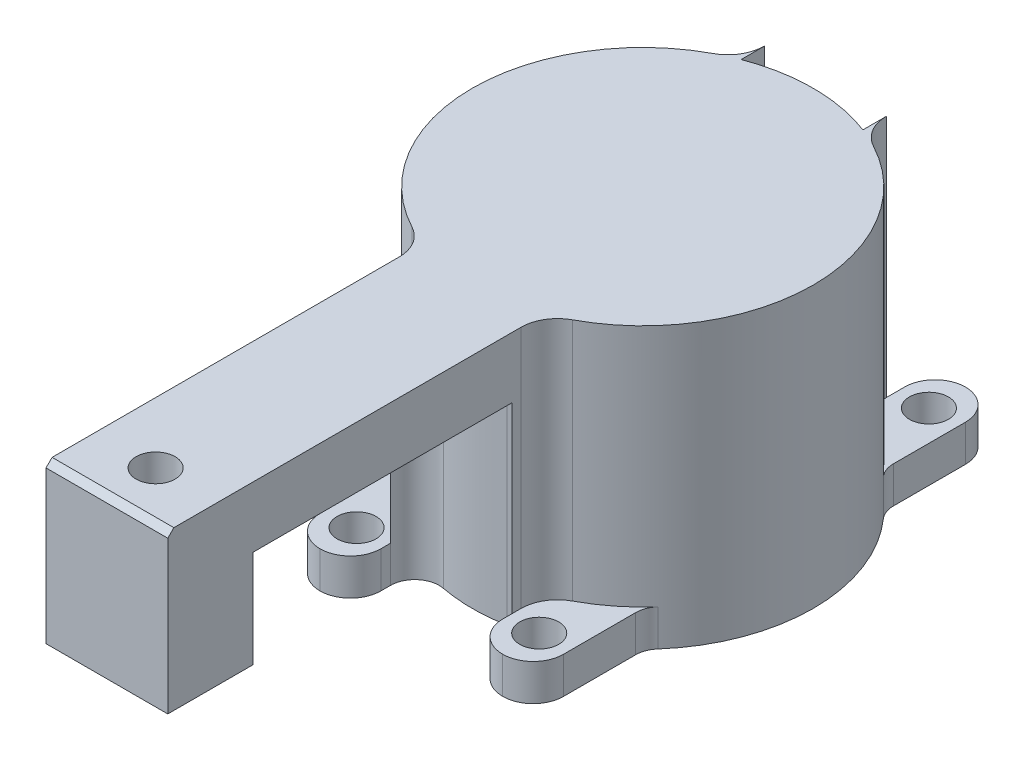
ISO-10303-21;
HEADER;
FILE_DESCRIPTION(('STEP AP214'),'2;1');
FILE_NAME('part.step','',(''),(''),'','','');
FILE_SCHEMA(('AUTOMOTIVE_DESIGN { 1 0 10303 214 1 1 1 1 }'));
ENDSEC;
DATA;
#1=APPLICATION_CONTEXT('core data for automotive mechanical design processes');
#2=APPLICATION_PROTOCOL_DEFINITION('international standard','automotive_design',2000,#1);
#3=PRODUCT_CONTEXT('',#1,'mechanical');
#4=PRODUCT('Part','Part','',(#3));
#5=PRODUCT_RELATED_PRODUCT_CATEGORY('part','',(#4));
#6=PRODUCT_DEFINITION_FORMATION('','',#4);
#7=PRODUCT_DEFINITION_CONTEXT('part definition',#1,'design');
#8=PRODUCT_DEFINITION('design','',#6,#7);
#9=PRODUCT_DEFINITION_SHAPE('','',#8);
#10=(LENGTH_UNIT() NAMED_UNIT(*) SI_UNIT(.MILLI.,.METRE.));
#11=(NAMED_UNIT(*) PLANE_ANGLE_UNIT() SI_UNIT($,.RADIAN.));
#12=(NAMED_UNIT(*) SI_UNIT($,.STERADIAN.) SOLID_ANGLE_UNIT());
#13=UNCERTAINTY_MEASURE_WITH_UNIT(LENGTH_MEASURE(1.E-05),#10,'distance_accuracy_value','');
#14=(GEOMETRIC_REPRESENTATION_CONTEXT(3) GLOBAL_UNCERTAINTY_ASSIGNED_CONTEXT((#13)) GLOBAL_UNIT_ASSIGNED_CONTEXT((#10,
#11,#12)) REPRESENTATION_CONTEXT('',''));
#15=CARTESIAN_POINT('',(0.,0.,0.));
#16=DIRECTION('',(0.,0.,1.));
#17=DIRECTION('',(1.,0.,0.));
#18=AXIS2_PLACEMENT_3D('',#15,#16,#17);
#19=CARTESIAN_POINT('',(0.,23.,0.));
#20=DIRECTION('',(0.,1.,0.));
#21=DIRECTION('',(0.,0.,1.));
#22=AXIS2_PLACEMENT_3D('',#19,#20,#21);
#23=PLANE('',#22);
#24=CARTESIAN_POINT('',(0.,23.,40.));
#25=DIRECTION('',(0.,1.,0.));
#26=DIRECTION('',(0.,0.,-1.));
#27=AXIS2_PLACEMENT_3D('',#24,#25,#26);
#28=CIRCLE('',#27,1.6);
#29=CARTESIAN_POINT('',(0.,23.,38.4));
#30=VERTEX_POINT('',#29);
#31=EDGE_CURVE('E349',#30,#30,#28,.T.);
#32=ORIENTED_EDGE('',*,*,#31,.F.);
#33=EDGE_LOOP('',(#32));
#34=FACE_BOUND('',#33,.T.);
#35=DIRECTION('',(0.,0.,1.));
#36=VECTOR('',#35,1.);
#37=CARTESIAN_POINT('',(-5.,23.,-44.));
#38=LINE('',#37,#36);
#39=CARTESIAN_POINT('',(-5.,23.,-15.));
#40=VERTEX_POINT('',#39);
#41=CARTESIAN_POINT('',(-4.99999999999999,23.,-13.076696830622));
#42=VERTEX_POINT('',#41);
#43=EDGE_CURVE('E321',#40,#42,#38,.T.);
#44=ORIENTED_EDGE('',*,*,#43,.F.);
#45=CARTESIAN_POINT('',(-8.,23.,-15.));
#46=DIRECTION('',(0.,1.,0.));
#47=DIRECTION('',(0.,0.,1.));
#48=AXIS2_PLACEMENT_3D('',#45,#46,#47);
#49=CIRCLE('',#48,3.);
#50=CARTESIAN_POINT('',(-6.58823529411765,23.,-12.3529411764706));
#51=VERTEX_POINT('',#50);
#52=EDGE_CURVE('E361',#51,#40,#49,.T.);
#53=ORIENTED_EDGE('',*,*,#52,.F.);
#54=CARTESIAN_POINT('',(0.,23.,0.));
#55=DIRECTION('',(0.,1.,0.));
#56=DIRECTION('',(0.,0.,1.));
#57=AXIS2_PLACEMENT_3D('',#54,#55,#56);
#58=CIRCLE('',#57,14.);
#59=CARTESIAN_POINT('',(-6.58823529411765,23.,12.3529411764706));
#60=VERTEX_POINT('',#59);
#61=EDGE_CURVE('E501',#51,#60,#58,.T.);
#62=ORIENTED_EDGE('',*,*,#61,.T.);
#63=CARTESIAN_POINT('',(-8.,23.,15.));
#64=DIRECTION('',(0.,1.,0.));
#65=DIRECTION('',(0.,0.,1.));
#66=AXIS2_PLACEMENT_3D('',#63,#64,#65);
#67=CIRCLE('',#66,3.);
#68=CARTESIAN_POINT('',(-4.99999999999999,23.,15.));
#69=VERTEX_POINT('',#68);
#70=EDGE_CURVE('E379',#60,#69,#67,.F.);
#71=ORIENTED_EDGE('',*,*,#70,.T.);
#72=DIRECTION('',(0.,0.,1.));
#73=VECTOR('',#72,1.);
#74=CARTESIAN_POINT('',(-4.99999999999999,23.,43.));
#75=LINE('',#74,#73);
#76=CARTESIAN_POINT('',(-4.99999999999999,23.,43.5));
#77=VERTEX_POINT('',#76);
#78=EDGE_CURVE('E413',#69,#77,#75,.T.);
#79=ORIENTED_EDGE('',*,*,#78,.T.);
#80=DIRECTION('',(1.,0.,0.));
#81=VECTOR('',#80,1.);
#82=CARTESIAN_POINT('',(0.,23.,43.5));
#83=LINE('',#82,#81);
#84=CARTESIAN_POINT('',(5.00000000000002,23.,43.5));
#85=VERTEX_POINT('',#84);
#86=EDGE_CURVE('E651',#77,#85,#83,.T.);
#87=ORIENTED_EDGE('',*,*,#86,.T.);
#88=DIRECTION('',(0.,0.,-1.));
#89=VECTOR('',#88,1.);
#90=CARTESIAN_POINT('',(5.,23.,13.076696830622));
#91=LINE('',#90,#89);
#92=CARTESIAN_POINT('',(5.00000000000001,23.,15.));
#93=VERTEX_POINT('',#92);
#94=EDGE_CURVE('E417',#85,#93,#91,.T.);
#95=ORIENTED_EDGE('',*,*,#94,.T.);
#96=CARTESIAN_POINT('',(8.,23.,15.));
#97=DIRECTION('',(0.,1.,0.));
#98=DIRECTION('',(0.,0.,1.));
#99=AXIS2_PLACEMENT_3D('',#96,#97,#98);
#100=CIRCLE('',#99,3.);
#101=CARTESIAN_POINT('',(6.58823529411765,23.,12.3529411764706));
#102=VERTEX_POINT('',#101);
#103=EDGE_CURVE('E366',#93,#102,#100,.F.);
#104=ORIENTED_EDGE('',*,*,#103,.T.);
#105=CARTESIAN_POINT('',(6.58823529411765,23.,-12.3529411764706));
#106=VERTEX_POINT('',#105);
#107=EDGE_CURVE('E496',#102,#106,#58,.T.);
#108=ORIENTED_EDGE('',*,*,#107,.T.);
#109=CARTESIAN_POINT('',(8.,23.,-15.));
#110=DIRECTION('',(0.,1.,0.));
#111=DIRECTION('',(0.,0.,1.));
#112=AXIS2_PLACEMENT_3D('',#109,#110,#111);
#113=CIRCLE('',#112,3.);
#114=CARTESIAN_POINT('',(5.,23.,-15.));
#115=VERTEX_POINT('',#114);
#116=EDGE_CURVE('E352',#106,#115,#113,.F.);
#117=ORIENTED_EDGE('',*,*,#116,.T.);
#118=DIRECTION('',(0.,0.,-1.));
#119=VECTOR('',#118,1.);
#120=CARTESIAN_POINT('',(5.,23.,-44.));
#121=LINE('',#120,#119);
#122=CARTESIAN_POINT('',(5.,23.,-13.076696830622));
#123=VERTEX_POINT('',#122);
#124=EDGE_CURVE('E318',#123,#115,#121,.T.);
#125=ORIENTED_EDGE('',*,*,#124,.F.);
#126=CARTESIAN_POINT('',(0.,23.,0.));
#127=DIRECTION('',(0.,-1.,0.));
#128=DIRECTION('',(0.,0.,1.));
#129=AXIS2_PLACEMENT_3D('',#126,#127,#128);
#130=CIRCLE('',#129,14.);
#131=EDGE_CURVE('E311',#42,#123,#130,.T.);
#132=ORIENTED_EDGE('',*,*,#131,.F.);
#133=EDGE_LOOP('',(#44,#53,#62,#71,#79,#87,#95,#104,#108,#117,#125,#132));
#134=FACE_BOUND('',#133,.T.);
#135=ADVANCED_FACE('F37',(#34,#134),#23,.T.);
#136=CARTESIAN_POINT('',(0.,6.,0.));
#137=DIRECTION('',(0.,1.,0.));
#138=DIRECTION('',(0.,0.,1.));
#139=AXIS2_PLACEMENT_3D('',#136,#137,#138);
#140=PLANE('',#139);
#141=DIRECTION('',(0.,0.,-1.));
#142=VECTOR('',#141,1.);
#143=CARTESIAN_POINT('',(-4.99999999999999,6.,-19.));
#144=LINE('',#143,#142);
#145=CARTESIAN_POINT('',(-4.99999999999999,6.,-12.));
#146=VERTEX_POINT('',#145);
#147=CARTESIAN_POINT('',(-4.99999999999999,6.,-13.076696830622));
#148=VERTEX_POINT('',#147);
#149=EDGE_CURVE('E443',#146,#148,#144,.T.);
#150=ORIENTED_EDGE('',*,*,#149,.T.);
#151=CARTESIAN_POINT('',(0.,6.,0.));
#152=DIRECTION('',(0.,1.,0.));
#153=DIRECTION('',(0.,0.,1.));
#154=AXIS2_PLACEMENT_3D('',#151,#152,#153);
#155=CIRCLE('',#154,14.);
#156=CARTESIAN_POINT('',(5.,6.,-13.076696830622));
#157=VERTEX_POINT('',#156);
#158=EDGE_CURVE('E313',#157,#148,#155,.T.);
#159=ORIENTED_EDGE('',*,*,#158,.F.);
#160=DIRECTION('',(0.,0.,1.));
#161=VECTOR('',#160,1.);
#162=CARTESIAN_POINT('',(5.,6.,-3.95062425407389));
#163=LINE('',#162,#161);
#164=CARTESIAN_POINT('',(5.,6.,-12.));
#165=VERTEX_POINT('',#164);
#166=EDGE_CURVE('E441',#157,#165,#163,.T.);
#167=ORIENTED_EDGE('',*,*,#166,.T.);
#168=CARTESIAN_POINT('',(0.,6.,0.));
#169=DIRECTION('',(0.,1.,0.));
#170=DIRECTION('',(0.,0.,1.));
#171=AXIS2_PLACEMENT_3D('',#168,#169,#170);
#172=CIRCLE('',#171,13.);
#173=EDGE_CURVE('E611',#165,#146,#172,.T.);
#174=ORIENTED_EDGE('',*,*,#173,.T.);
#175=EDGE_LOOP('',(#150,#159,#167,#174));
#176=FACE_BOUND('',#175,.T.);
#177=ADVANCED_FACE('F765',(#176),#140,.F.);
#178=CARTESIAN_POINT('',(-4.99999999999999,18.,43.));
#179=DIRECTION('',(-1.,0.,0.));
#180=DIRECTION('',(0.,0.,1.));
#181=AXIS2_PLACEMENT_3D('',#178,#179,#180);
#182=PLANE('',#181);
#183=DIRECTION('',(0.,-1.,0.));
#184=VECTOR('',#183,1.);
#185=CARTESIAN_POINT('',(-4.99999999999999,23.,44.));
#186=LINE('',#185,#184);
#187=CARTESIAN_POINT('',(-4.99999999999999,22.5,44.));
#188=VERTEX_POINT('',#187);
#189=CARTESIAN_POINT('',(-4.99999999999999,10.,44.));
#190=VERTEX_POINT('',#189);
#191=EDGE_CURVE('E334',#188,#190,#186,.T.);
#192=ORIENTED_EDGE('',*,*,#191,.F.);
#193=DIRECTION('',(0.,-0.707106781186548,0.707106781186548));
#194=VECTOR('',#193,1.);
#195=CARTESIAN_POINT('',(-4.99999999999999,20.75,45.75));
#196=LINE('',#195,#194);
#197=EDGE_CURVE('E45',#188,#77,#196,.F.);
#198=ORIENTED_EDGE('',*,*,#197,.T.);
#199=ORIENTED_EDGE('',*,*,#78,.F.);
#200=DIRECTION('',(0.,1.,0.));
#201=VECTOR('',#200,1.);
#202=CARTESIAN_POINT('',(-4.99999999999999,-0.0869745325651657,15.));
#203=LINE('',#202,#201);
#204=CARTESIAN_POINT('',(-5.,3.,15.));
#205=VERTEX_POINT('',#204);
#206=EDGE_CURVE('E384',#205,#69,#203,.T.);
#207=ORIENTED_EDGE('',*,*,#206,.F.);
#208=DIRECTION('',(0.,0.,1.));
#209=VECTOR('',#208,1.);
#210=CARTESIAN_POINT('',(-5.,3.,15.7162336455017));
#211=LINE('',#210,#209);
#212=CARTESIAN_POINT('',(-5.,3.,15.7162336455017));
#213=VERTEX_POINT('',#212);
#214=EDGE_CURVE('E393',#205,#213,#211,.T.);
#215=ORIENTED_EDGE('',*,*,#214,.T.);
#216=DIRECTION('',(0.,-1.,0.));
#217=VECTOR('',#216,1.);
#218=CARTESIAN_POINT('',(-5.,21.5507435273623,15.7162336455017));
#219=LINE('',#218,#217);
#220=CARTESIAN_POINT('',(-4.99999999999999,18.,15.7162336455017));
#221=VERTEX_POINT('',#220);
#222=EDGE_CURVE('E403',#221,#213,#219,.T.);
#223=ORIENTED_EDGE('',*,*,#222,.F.);
#224=DIRECTION('',(0.,0.,1.));
#225=VECTOR('',#224,1.);
#226=CARTESIAN_POINT('',(-4.99999999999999,18.,43.));
#227=LINE('',#226,#225);
#228=CARTESIAN_POINT('',(-4.99999999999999,18.,37.));
#229=VERTEX_POINT('',#228);
#230=EDGE_CURVE('E416',#221,#229,#227,.T.);
#231=ORIENTED_EDGE('',*,*,#230,.T.);
#232=DIRECTION('',(0.,1.,0.));
#233=VECTOR('',#232,1.);
#234=CARTESIAN_POINT('',(-4.99999999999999,8.,37.));
#235=LINE('',#234,#233);
#236=CARTESIAN_POINT('',(-4.99999999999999,10.,37.));
#237=VERTEX_POINT('',#236);
#238=EDGE_CURVE('E411',#237,#229,#235,.T.);
#239=ORIENTED_EDGE('',*,*,#238,.F.);
#240=DIRECTION('',(0.,0.,-1.));
#241=VECTOR('',#240,1.);
#242=CARTESIAN_POINT('',(-4.99999999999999,10.,43.));
#243=LINE('',#242,#241);
#244=EDGE_CURVE('E342',#190,#237,#243,.T.);
#245=ORIENTED_EDGE('',*,*,#244,.F.);
#246=EDGE_LOOP('',(#192,#198,#199,#207,#215,#223,#231,#239,#245));
#247=FACE_BOUND('',#246,.T.);
#248=ADVANCED_FACE('F659',(#247),#182,.T.);
#249=CARTESIAN_POINT('',(5.,18.,13.076696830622));
#250=DIRECTION('',(1.,0.,0.));
#251=DIRECTION('',(0.,0.,-1.));
#252=AXIS2_PLACEMENT_3D('',#249,#250,#251);
#253=PLANE('',#252);
#254=ORIENTED_EDGE('',*,*,#94,.F.);
#255=DIRECTION('',(0.,0.707106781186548,-0.707106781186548));
#256=VECTOR('',#255,1.);
#257=CARTESIAN_POINT('',(5.00000000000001,35.711651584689,30.788348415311));
#258=LINE('',#257,#256);
#259=CARTESIAN_POINT('',(5.00000000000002,22.5,44.));
#260=VERTEX_POINT('',#259);
#261=EDGE_CURVE('E11',#85,#260,#258,.F.);
#262=ORIENTED_EDGE('',*,*,#261,.T.);
#263=DIRECTION('',(0.,1.,0.));
#264=VECTOR('',#263,1.);
#265=CARTESIAN_POINT('',(5.00000000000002,10.,44.));
#266=LINE('',#265,#264);
#267=CARTESIAN_POINT('',(5.00000000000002,10.,44.));
#268=VERTEX_POINT('',#267);
#269=EDGE_CURVE('E340',#268,#260,#266,.T.);
#270=ORIENTED_EDGE('',*,*,#269,.F.);
#271=DIRECTION('',(0.,0.,1.));
#272=VECTOR('',#271,1.);
#273=CARTESIAN_POINT('',(5.00000000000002,10.,37.));
#274=LINE('',#273,#272);
#275=CARTESIAN_POINT('',(5.00000000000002,10.,37.));
#276=VERTEX_POINT('',#275);
#277=EDGE_CURVE('E346',#276,#268,#274,.T.);
#278=ORIENTED_EDGE('',*,*,#277,.F.);
#279=DIRECTION('',(0.,1.,0.));
#280=VECTOR('',#279,1.);
#281=CARTESIAN_POINT('',(5.00000000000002,8.,37.));
#282=LINE('',#281,#280);
#283=CARTESIAN_POINT('',(5.00000000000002,18.,37.));
#284=VERTEX_POINT('',#283);
#285=EDGE_CURVE('E409',#276,#284,#282,.T.);
#286=ORIENTED_EDGE('',*,*,#285,.T.);
#287=DIRECTION('',(0.,0.,-1.));
#288=VECTOR('',#287,1.);
#289=CARTESIAN_POINT('',(5.,18.,13.076696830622));
#290=LINE('',#289,#288);
#291=CARTESIAN_POINT('',(5.,18.,15.7162336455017));
#292=VERTEX_POINT('',#291);
#293=EDGE_CURVE('E420',#284,#292,#290,.T.);
#294=ORIENTED_EDGE('',*,*,#293,.T.);
#295=DIRECTION('',(0.,-1.,0.));
#296=VECTOR('',#295,1.);
#297=CARTESIAN_POINT('',(5.,21.5507435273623,15.7162336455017));
#298=LINE('',#297,#296);
#299=CARTESIAN_POINT('',(5.,3.,15.7162336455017));
#300=VERTEX_POINT('',#299);
#301=EDGE_CURVE('E394',#292,#300,#298,.T.);
#302=ORIENTED_EDGE('',*,*,#301,.T.);
#303=DIRECTION('',(0.,0.,1.));
#304=VECTOR('',#303,1.);
#305=CARTESIAN_POINT('',(5.,3.,15.7162336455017));
#306=LINE('',#305,#304);
#307=CARTESIAN_POINT('',(5.,3.,15.));
#308=VERTEX_POINT('',#307);
#309=EDGE_CURVE('E389',#308,#300,#306,.T.);
#310=ORIENTED_EDGE('',*,*,#309,.F.);
#311=DIRECTION('',(0.,1.,0.));
#312=VECTOR('',#311,1.);
#313=CARTESIAN_POINT('',(5.00000000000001,-0.0869745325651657,15.));
#314=LINE('',#313,#312);
#315=EDGE_CURVE('E376',#308,#93,#314,.T.);
#316=ORIENTED_EDGE('',*,*,#315,.T.);
#317=EDGE_LOOP('',(#254,#262,#270,#278,#286,#294,#302,#310,#316));
#318=FACE_BOUND('',#317,.T.);
#319=ADVANCED_FACE('F667',(#318),#253,.T.);
#320=CARTESIAN_POINT('',(-4.99999999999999,8.,37.));
#321=DIRECTION('',(0.,0.,1.));
#322=DIRECTION('',(1.,0.,0.));
#323=AXIS2_PLACEMENT_3D('',#320,#321,#322);
#324=PLANE('',#323);
#325=DIRECTION('',(1.,0.,0.));
#326=VECTOR('',#325,1.);
#327=CARTESIAN_POINT('',(-4.99999999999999,10.,37.));
#328=LINE('',#327,#326);
#329=EDGE_CURVE('E344',#237,#276,#328,.T.);
#330=ORIENTED_EDGE('',*,*,#329,.F.);
#331=ORIENTED_EDGE('',*,*,#238,.T.);
#332=DIRECTION('',(1.,0.,0.));
#333=VECTOR('',#332,1.);
#334=CARTESIAN_POINT('',(-4.99999999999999,18.,37.));
#335=LINE('',#334,#333);
#336=EDGE_CURVE('E402',#229,#284,#335,.T.);
#337=ORIENTED_EDGE('',*,*,#336,.T.);
#338=ORIENTED_EDGE('',*,*,#285,.F.);
#339=EDGE_LOOP('',(#330,#331,#337,#338));
#340=FACE_BOUND('',#339,.T.);
#341=ADVANCED_FACE('F672',(#340),#324,.F.);
#342=CARTESIAN_POINT('',(0.,0.,40.));
#343=DIRECTION('',(0.,1.,0.));
#344=DIRECTION('',(0.,0.,1.));
#345=AXIS2_PLACEMENT_3D('',#342,#343,#344);
#346=CYLINDRICAL_SURFACE('',#345,1.6);
#347=ORIENTED_EDGE('',*,*,#31,.T.);
#348=EDGE_LOOP('',(#347));
#349=FACE_BOUND('',#348,.T.);
#350=CARTESIAN_POINT('',(0.,10.,40.));
#351=DIRECTION('',(0.,-1.,0.));
#352=DIRECTION('',(0.,0.,-1.));
#353=AXIS2_PLACEMENT_3D('',#350,#351,#352);
#354=CIRCLE('',#353,1.6);
#355=CARTESIAN_POINT('',(0.,10.,38.4));
#356=VERTEX_POINT('',#355);
#357=EDGE_CURVE('E348',#356,#356,#354,.F.);
#358=ORIENTED_EDGE('',*,*,#357,.F.);
#359=EDGE_LOOP('',(#358));
#360=FACE_BOUND('',#359,.T.);
#361=ADVANCED_FACE('F857',(#349,#360),#346,.F.);
#362=CARTESIAN_POINT('',(0.,22.,0.));
#363=DIRECTION('',(0.,-1.,0.));
#364=DIRECTION('',(0.,0.,-1.));
#365=AXIS2_PLACEMENT_3D('',#362,#363,#364);
#366=CYLINDRICAL_SURFACE('',#365,14.);
#367=DIRECTION('',(0.,1.,0.));
#368=VECTOR('',#367,1.);
#369=CARTESIAN_POINT('',(5.,0.,-13.076696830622));
#370=LINE('',#369,#368);
#371=EDGE_CURVE('E317',#157,#123,#370,.T.);
#372=ORIENTED_EDGE('',*,*,#371,.F.);
#373=ORIENTED_EDGE('',*,*,#158,.T.);
#374=DIRECTION('',(0.,1.,0.));
#375=VECTOR('',#374,1.);
#376=CARTESIAN_POINT('',(-4.99999999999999,0.,-13.076696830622));
#377=LINE('',#376,#375);
#378=EDGE_CURVE('E306',#148,#42,#377,.T.);
#379=ORIENTED_EDGE('',*,*,#378,.T.);
#380=ORIENTED_EDGE('',*,*,#131,.T.);
#381=EDGE_LOOP('',(#372,#373,#379,#380));
#382=FACE_BOUND('',#381,.T.);
#383=ADVANCED_FACE('F309',(#382),#366,.T.);
#384=DIRECTION('',(0.,1.,0.));
#385=VECTOR('',#384,1.);
#386=CARTESIAN_POINT('',(-6.58823529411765,-0.0869745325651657,-12.3529411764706));
#387=LINE('',#386,#385);
#388=CARTESIAN_POINT('',(-6.58823529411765,3.,-12.3529411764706));
#389=VERTEX_POINT('',#388);
#390=EDGE_CURVE('E360',#389,#51,#387,.T.);
#391=ORIENTED_EDGE('',*,*,#390,.F.);
#392=CARTESIAN_POINT('',(0.,3.,0.));
#393=DIRECTION('',(0.,1.,0.));
#394=DIRECTION('',(0.,0.,1.));
#395=AXIS2_PLACEMENT_3D('',#392,#393,#394);
#396=CIRCLE('',#395,14.);
#397=CARTESIAN_POINT('',(-10.5,3.,-9.26012958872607));
#398=VERTEX_POINT('',#397);
#399=EDGE_CURVE('E452',#389,#398,#396,.T.);
#400=ORIENTED_EDGE('',*,*,#399,.T.);
#401=DIRECTION('',(0.,-1.,0.));
#402=VECTOR('',#401,1.);
#403=CARTESIAN_POINT('',(-10.5,22.,-9.26012958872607));
#404=LINE('',#403,#402);
#405=CARTESIAN_POINT('',(-10.5,0.,-9.26012958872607));
#406=VERTEX_POINT('',#405);
#407=EDGE_CURVE('E562',#398,#406,#404,.T.);
#408=ORIENTED_EDGE('',*,*,#407,.T.);
#409=CARTESIAN_POINT('',(0.,0.,0.));
#410=DIRECTION('',(0.,1.,0.));
#411=DIRECTION('',(0.,0.,1.));
#412=AXIS2_PLACEMENT_3D('',#409,#410,#411);
#413=CIRCLE('',#412,14.);
#414=CARTESIAN_POINT('',(-10.5,0.,9.26012958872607));
#415=VERTEX_POINT('',#414);
#416=EDGE_CURVE('E509',#406,#415,#413,.T.);
#417=ORIENTED_EDGE('',*,*,#416,.T.);
#418=DIRECTION('',(0.,-1.,0.));
#419=VECTOR('',#418,1.);
#420=CARTESIAN_POINT('',(-10.5,22.,9.26012958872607));
#421=LINE('',#420,#419);
#422=CARTESIAN_POINT('',(-10.5,3.,9.26012958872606));
#423=VERTEX_POINT('',#422);
#424=EDGE_CURVE('E565',#415,#423,#421,.F.);
#425=ORIENTED_EDGE('',*,*,#424,.T.);
#426=CARTESIAN_POINT('',(0.,3.,0.));
#427=DIRECTION('',(0.,1.,0.));
#428=DIRECTION('',(0.,0.,-1.));
#429=AXIS2_PLACEMENT_3D('',#426,#427,#428);
#430=CIRCLE('',#429,14.);
#431=CARTESIAN_POINT('',(-6.58823529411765,3.,12.3529411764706));
#432=VERTEX_POINT('',#431);
#433=EDGE_CURVE('E486',#423,#432,#430,.T.);
#434=ORIENTED_EDGE('',*,*,#433,.T.);
#435=DIRECTION('',(0.,1.,0.));
#436=VECTOR('',#435,1.);
#437=CARTESIAN_POINT('',(-6.58823529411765,-0.0869745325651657,12.3529411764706));
#438=LINE('',#437,#436);
#439=EDGE_CURVE('E386',#432,#60,#438,.T.);
#440=ORIENTED_EDGE('',*,*,#439,.T.);
#441=ORIENTED_EDGE('',*,*,#61,.F.);
#442=EDGE_LOOP('',(#391,#400,#408,#417,#425,#434,#440,#441));
#443=FACE_BOUND('',#442,.T.);
#444=ADVANCED_FACE('F792',(#443),#366,.T.);
#445=CARTESIAN_POINT('',(0.,3.,0.));
#446=DIRECTION('',(0.,1.,0.));
#447=DIRECTION('',(0.,0.,-1.));
#448=AXIS2_PLACEMENT_3D('',#445,#446,#447);
#449=CIRCLE('',#448,14.);
#450=CARTESIAN_POINT('',(10.5,3.,-9.26012958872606));
#451=VERTEX_POINT('',#450);
#452=CARTESIAN_POINT('',(6.58823529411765,3.,-12.3529411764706));
#453=VERTEX_POINT('',#452);
#454=EDGE_CURVE('E462',#451,#453,#449,.T.);
#455=ORIENTED_EDGE('',*,*,#454,.T.);
#456=DIRECTION('',(0.,1.,0.));
#457=VECTOR('',#456,1.);
#458=CARTESIAN_POINT('',(6.58823529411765,-0.0869745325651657,-12.3529411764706));
#459=LINE('',#458,#457);
#460=EDGE_CURVE('E357',#453,#106,#459,.T.);
#461=ORIENTED_EDGE('',*,*,#460,.T.);
#462=ORIENTED_EDGE('',*,*,#107,.F.);
#463=DIRECTION('',(0.,1.,0.));
#464=VECTOR('',#463,1.);
#465=CARTESIAN_POINT('',(6.58823529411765,-0.0869745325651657,12.3529411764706));
#466=LINE('',#465,#464);
#467=CARTESIAN_POINT('',(6.58823529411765,3.,12.3529411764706));
#468=VERTEX_POINT('',#467);
#469=EDGE_CURVE('E373',#468,#102,#466,.T.);
#470=ORIENTED_EDGE('',*,*,#469,.F.);
#471=CARTESIAN_POINT('',(0.,3.,0.));
#472=DIRECTION('',(0.,1.,0.));
#473=DIRECTION('',(0.,0.,1.));
#474=AXIS2_PLACEMENT_3D('',#471,#472,#473);
#475=CIRCLE('',#474,14.);
#476=CARTESIAN_POINT('',(10.5,3.,9.26012958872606));
#477=VERTEX_POINT('',#476);
#478=EDGE_CURVE('E478',#468,#477,#475,.T.);
#479=ORIENTED_EDGE('',*,*,#478,.T.);
#480=DIRECTION('',(0.,-1.,0.));
#481=VECTOR('',#480,1.);
#482=CARTESIAN_POINT('',(10.5,22.,9.26012958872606));
#483=LINE('',#482,#481);
#484=CARTESIAN_POINT('',(10.5,0.,9.26012958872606));
#485=VERTEX_POINT('',#484);
#486=EDGE_CURVE('E556',#477,#485,#483,.T.);
#487=ORIENTED_EDGE('',*,*,#486,.T.);
#488=CARTESIAN_POINT('',(10.5,0.,-9.26012958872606));
#489=VERTEX_POINT('',#488);
#490=EDGE_CURVE('E510',#485,#489,#413,.T.);
#491=ORIENTED_EDGE('',*,*,#490,.T.);
#492=DIRECTION('',(0.,-1.,0.));
#493=VECTOR('',#492,1.);
#494=CARTESIAN_POINT('',(10.5,22.,-9.26012958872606));
#495=LINE('',#494,#493);
#496=EDGE_CURVE('E559',#489,#451,#495,.F.);
#497=ORIENTED_EDGE('',*,*,#496,.T.);
#498=EDGE_LOOP('',(#455,#461,#462,#470,#479,#487,#491,#497));
#499=FACE_BOUND('',#498,.T.);
#500=ADVANCED_FACE('F703',(#499),#366,.T.);
#501=CARTESIAN_POINT('',(0.,3.,0.));
#502=DIRECTION('',(0.,1.,0.));
#503=DIRECTION('',(0.,0.,1.));
#504=AXIS2_PLACEMENT_3D('',#501,#502,#503);
#505=PLANE('',#504);
#506=CARTESIAN_POINT('',(-7.5,3.,-16.));
#507=DIRECTION('',(0.,1.,0.));
#508=DIRECTION('',(0.,0.,1.));
#509=AXIS2_PLACEMENT_3D('',#506,#507,#508);
#510=CIRCLE('',#509,1.6);
#511=CARTESIAN_POINT('',(-7.5,3.,-14.4));
#512=VERTEX_POINT('',#511);
#513=EDGE_CURVE('E439',#512,#512,#510,.T.);
#514=ORIENTED_EDGE('',*,*,#513,.F.);
#515=EDGE_LOOP('',(#514));
#516=FACE_BOUND('',#515,.T.);
#517=DIRECTION('',(0.,0.,1.));
#518=VECTOR('',#517,1.);
#519=CARTESIAN_POINT('',(-4.99999999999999,3.,-13.076696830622));
#520=LINE('',#519,#518);
#521=CARTESIAN_POINT('',(-4.99999999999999,3.,-16.5));
#522=VERTEX_POINT('',#521);
#523=CARTESIAN_POINT('',(-4.99999999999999,3.,-15.));
#524=VERTEX_POINT('',#523);
#525=EDGE_CURVE('E457',#522,#524,#520,.T.);
#526=ORIENTED_EDGE('',*,*,#525,.F.);
#527=CARTESIAN_POINT('',(-7.49999999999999,3.,-16.5));
#528=DIRECTION('',(0.,1.,0.));
#529=DIRECTION('',(0.,0.,1.));
#530=AXIS2_PLACEMENT_3D('',#527,#528,#529);
#531=CIRCLE('',#530,2.5);
#532=CARTESIAN_POINT('',(-7.49999999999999,3.,-19.));
#533=VERTEX_POINT('',#532);
#534=EDGE_CURVE('E635',#522,#533,#531,.T.);
#535=ORIENTED_EDGE('',*,*,#534,.T.);
#536=CARTESIAN_POINT('',(-7.49999999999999,3.,-16.5));
#537=DIRECTION('',(0.,1.,0.));
#538=DIRECTION('',(0.,0.,1.));
#539=AXIS2_PLACEMENT_3D('',#536,#537,#538);
#540=CIRCLE('',#539,2.5);
#541=CARTESIAN_POINT('',(-9.99999999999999,3.,-16.5));
#542=VERTEX_POINT('',#541);
#543=EDGE_CURVE('E553',#533,#542,#540,.T.);
#544=ORIENTED_EDGE('',*,*,#543,.T.);
#545=DIRECTION('',(0.,0.,-1.));
#546=VECTOR('',#545,1.);
#547=CARTESIAN_POINT('',(-9.99999999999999,3.,-19.));
#548=LINE('',#547,#546);
#549=CARTESIAN_POINT('',(-9.99999999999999,3.,-10.5830052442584));
#550=VERTEX_POINT('',#549);
#551=EDGE_CURVE('E454',#550,#542,#548,.T.);
#552=ORIENTED_EDGE('',*,*,#551,.F.);
#553=CARTESIAN_POINT('',(-12.,3.,-10.5830052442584));
#554=DIRECTION('',(0.,1.,0.));
#555=DIRECTION('',(0.,0.,1.));
#556=AXIS2_PLACEMENT_3D('',#553,#554,#555);
#557=CIRCLE('',#556,2.);
#558=EDGE_CURVE('E599',#550,#398,#557,.F.);
#559=ORIENTED_EDGE('',*,*,#558,.T.);
#560=ORIENTED_EDGE('',*,*,#399,.F.);
#561=CARTESIAN_POINT('',(-8.,3.,-15.));
#562=DIRECTION('',(0.,-1.,0.));
#563=DIRECTION('',(0.,0.,-1.));
#564=AXIS2_PLACEMENT_3D('',#561,#562,#563);
#565=CIRCLE('',#564,3.);
#566=EDGE_CURVE('E363',#389,#524,#565,.F.);
#567=ORIENTED_EDGE('',*,*,#566,.T.);
#568=EDGE_LOOP('',(#526,#535,#544,#552,#559,#560,#567));
#569=FACE_BOUND('',#568,.T.);
#570=ADVANCED_FACE('F1048',(#516,#569),#505,.T.);
#571=DIRECTION('',(0.,-1.,0.));
#572=VECTOR('',#571,1.);
#573=CARTESIAN_POINT('',(2.625,22.,13.751704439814));
#574=LINE('',#573,#572);
#575=CARTESIAN_POINT('',(2.625,0.,13.751704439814));
#576=VERTEX_POINT('',#575);
#577=CARTESIAN_POINT('',(2.625,18.,13.751704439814));
#578=VERTEX_POINT('',#577);
#579=EDGE_CURVE('E571',#576,#578,#574,.F.);
#580=ORIENTED_EDGE('',*,*,#579,.T.);
#581=CARTESIAN_POINT('',(0.,18.,0.));
#582=DIRECTION('',(0.,-1.,0.));
#583=DIRECTION('',(0.,0.,-1.));
#584=AXIS2_PLACEMENT_3D('',#581,#582,#583);
#585=CIRCLE('',#584,14.);
#586=CARTESIAN_POINT('',(-2.625,18.,13.751704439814));
#587=VERTEX_POINT('',#586);
#588=EDGE_CURVE('E414',#578,#587,#585,.T.);
#589=ORIENTED_EDGE('',*,*,#588,.T.);
#590=DIRECTION('',(0.,-1.,0.));
#591=VECTOR('',#590,1.);
#592=CARTESIAN_POINT('',(-2.625,22.,13.751704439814));
#593=LINE('',#592,#591);
#594=CARTESIAN_POINT('',(-2.625,0.,13.751704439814));
#595=VERTEX_POINT('',#594);
#596=EDGE_CURVE('E568',#587,#595,#593,.T.);
#597=ORIENTED_EDGE('',*,*,#596,.T.);
#598=EDGE_CURVE('E513',#595,#576,#413,.T.);
#599=ORIENTED_EDGE('',*,*,#598,.T.);
#600=EDGE_LOOP('',(#580,#589,#597,#599));
#601=FACE_BOUND('',#600,.T.);
#602=ADVANCED_FACE('F796',(#601),#366,.T.);
#603=CARTESIAN_POINT('',(0.,18.,0.));
#604=DIRECTION('',(0.,-1.,0.));
#605=DIRECTION('',(0.,0.,-1.));
#606=AXIS2_PLACEMENT_3D('',#603,#604,#605);
#607=PLANE('',#606);
#608=CARTESIAN_POINT('',(3.,18.,15.7162336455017));
#609=DIRECTION('',(0.,-1.,0.));
#610=DIRECTION('',(0.,0.,-1.));
#611=AXIS2_PLACEMENT_3D('',#608,#609,#610);
#612=CIRCLE('',#611,2.);
#613=EDGE_CURVE('E390',#578,#292,#612,.T.);
#614=ORIENTED_EDGE('',*,*,#613,.T.);
#615=ORIENTED_EDGE('',*,*,#293,.F.);
#616=ORIENTED_EDGE('',*,*,#336,.F.);
#617=ORIENTED_EDGE('',*,*,#230,.F.);
#618=CARTESIAN_POINT('',(-3.,18.,15.7162336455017));
#619=DIRECTION('',(0.,-1.,0.));
#620=DIRECTION('',(0.,0.,-1.));
#621=AXIS2_PLACEMENT_3D('',#618,#619,#620);
#622=CIRCLE('',#621,2.);
#623=EDGE_CURVE('E399',#587,#221,#622,.F.);
#624=ORIENTED_EDGE('',*,*,#623,.F.);
#625=ORIENTED_EDGE('',*,*,#588,.F.);
#626=EDGE_LOOP('',(#614,#615,#616,#617,#624,#625));
#627=FACE_BOUND('',#626,.T.);
#628=ADVANCED_FACE('F678',(#627),#607,.T.);
#629=CARTESIAN_POINT('',(0.,3.,0.));
#630=DIRECTION('',(0.,-1.,0.));
#631=DIRECTION('',(0.,0.,-1.));
#632=AXIS2_PLACEMENT_3D('',#629,#630,#631);
#633=PLANE('',#632);
#634=CARTESIAN_POINT('',(-7.5,3.,16.));
#635=DIRECTION('',(0.,-1.,0.));
#636=DIRECTION('',(0.,0.,-1.));
#637=AXIS2_PLACEMENT_3D('',#634,#635,#636);
#638=CIRCLE('',#637,1.6);
#639=CARTESIAN_POINT('',(-7.5,3.,14.4));
#640=VERTEX_POINT('',#639);
#641=EDGE_CURVE('E440',#640,#640,#638,.T.);
#642=ORIENTED_EDGE('',*,*,#641,.T.);
#643=EDGE_LOOP('',(#642));
#644=FACE_BOUND('',#643,.T.);
#645=CARTESIAN_POINT('',(-7.5,3.,16.5));
#646=DIRECTION('',(0.,-1.,0.));
#647=DIRECTION('',(0.,0.,-1.));
#648=AXIS2_PLACEMENT_3D('',#645,#646,#647);
#649=CIRCLE('',#648,2.5);
#650=CARTESIAN_POINT('',(-10.,3.,16.5));
#651=VERTEX_POINT('',#650);
#652=CARTESIAN_POINT('',(-7.5,3.,19.));
#653=VERTEX_POINT('',#652);
#654=EDGE_CURVE('E545',#651,#653,#649,.F.);
#655=ORIENTED_EDGE('',*,*,#654,.T.);
#656=CARTESIAN_POINT('',(-7.5,3.,16.5));
#657=DIRECTION('',(0.,-1.,0.));
#658=DIRECTION('',(0.,0.,-1.));
#659=AXIS2_PLACEMENT_3D('',#656,#657,#658);
#660=CIRCLE('',#659,2.5);
#661=CARTESIAN_POINT('',(-5.,3.,16.5));
#662=VERTEX_POINT('',#661);
#663=EDGE_CURVE('E645',#653,#662,#660,.F.);
#664=ORIENTED_EDGE('',*,*,#663,.T.);
#665=DIRECTION('',(0.,0.,1.));
#666=VECTOR('',#665,1.);
#667=CARTESIAN_POINT('',(-5.,3.,13.076696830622));
#668=LINE('',#667,#666);
#669=EDGE_CURVE('E489',#213,#662,#668,.T.);
#670=ORIENTED_EDGE('',*,*,#669,.F.);
#671=ORIENTED_EDGE('',*,*,#214,.F.);
#672=CARTESIAN_POINT('',(-8.,3.,15.));
#673=DIRECTION('',(0.,-1.,0.));
#674=DIRECTION('',(0.,0.,-1.));
#675=AXIS2_PLACEMENT_3D('',#672,#673,#674);
#676=CIRCLE('',#675,3.);
#677=EDGE_CURVE('E382',#432,#205,#676,.T.);
#678=ORIENTED_EDGE('',*,*,#677,.F.);
#679=ORIENTED_EDGE('',*,*,#433,.F.);
#680=CARTESIAN_POINT('',(-12.,3.,10.5830052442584));
#681=DIRECTION('',(0.,-1.,0.));
#682=DIRECTION('',(0.,0.,-1.));
#683=AXIS2_PLACEMENT_3D('',#680,#681,#682);
#684=CIRCLE('',#683,2.);
#685=CARTESIAN_POINT('',(-10.,3.,10.5830052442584));
#686=VERTEX_POINT('',#685);
#687=EDGE_CURVE('E595',#423,#686,#684,.T.);
#688=ORIENTED_EDGE('',*,*,#687,.T.);
#689=DIRECTION('',(0.,0.,-1.));
#690=VECTOR('',#689,1.);
#691=CARTESIAN_POINT('',(-10.,3.,19.));
#692=LINE('',#691,#690);
#693=EDGE_CURVE('E493',#651,#686,#692,.T.);
#694=ORIENTED_EDGE('',*,*,#693,.F.);
#695=EDGE_LOOP('',(#655,#664,#670,#671,#678,#679,#688,#694));
#696=FACE_BOUND('',#695,.T.);
#697=ADVANCED_FACE('F790',(#644,#696),#633,.F.);
#698=CARTESIAN_POINT('',(0.,0.,0.));
#699=DIRECTION('',(0.,1.,0.));
#700=DIRECTION('',(0.,0.,1.));
#701=AXIS2_PLACEMENT_3D('',#698,#699,#700);
#702=PLANE('',#701);
#703=CARTESIAN_POINT('',(-7.5,0.,16.));
#704=DIRECTION('',(0.,-1.,0.));
#705=DIRECTION('',(0.,0.,-1.));
#706=AXIS2_PLACEMENT_3D('',#703,#704,#705);
#707=CIRCLE('',#706,1.6);
#708=CARTESIAN_POINT('',(-7.5,0.,14.4));
#709=VERTEX_POINT('',#708);
#710=EDGE_CURVE('E427',#709,#709,#707,.T.);
#711=ORIENTED_EDGE('',*,*,#710,.F.);
#712=EDGE_LOOP('',(#711));
#713=FACE_BOUND('',#712,.T.);
#714=CARTESIAN_POINT('',(7.5,0.,16.));
#715=DIRECTION('',(0.,-1.,0.));
#716=DIRECTION('',(0.,0.,1.));
#717=AXIS2_PLACEMENT_3D('',#714,#715,#716);
#718=CIRCLE('',#717,1.6);
#719=CARTESIAN_POINT('',(7.5,0.,17.6));
#720=VERTEX_POINT('',#719);
#721=EDGE_CURVE('E431',#720,#720,#718,.T.);
#722=ORIENTED_EDGE('',*,*,#721,.F.);
#723=EDGE_LOOP('',(#722));
#724=FACE_BOUND('',#723,.T.);
#725=CARTESIAN_POINT('',(7.5,0.,-16.));
#726=DIRECTION('',(0.,-1.,0.));
#727=DIRECTION('',(0.,0.,1.));
#728=AXIS2_PLACEMENT_3D('',#725,#726,#727);
#729=CIRCLE('',#728,1.6);
#730=CARTESIAN_POINT('',(7.5,0.,-14.4));
#731=VERTEX_POINT('',#730);
#732=EDGE_CURVE('E423',#731,#731,#729,.T.);
#733=ORIENTED_EDGE('',*,*,#732,.F.);
#734=EDGE_LOOP('',(#733));
#735=FACE_BOUND('',#734,.T.);
#736=CARTESIAN_POINT('',(-7.5,0.,-16.));
#737=DIRECTION('',(0.,-1.,0.));
#738=DIRECTION('',(0.,0.,-1.));
#739=AXIS2_PLACEMENT_3D('',#736,#737,#738);
#740=CIRCLE('',#739,1.6);
#741=CARTESIAN_POINT('',(-7.5,0.,-17.6));
#742=VERTEX_POINT('',#741);
#743=EDGE_CURVE('E436',#742,#742,#740,.T.);
#744=ORIENTED_EDGE('',*,*,#743,.F.);
#745=EDGE_LOOP('',(#744));
#746=FACE_BOUND('',#745,.T.);
#747=CARTESIAN_POINT('',(-7.49999999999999,0.,-16.5));
#748=DIRECTION('',(0.,1.,0.));
#749=DIRECTION('',(0.,0.,1.));
#750=AXIS2_PLACEMENT_3D('',#747,#748,#749);
#751=CIRCLE('',#750,2.5);
#752=CARTESIAN_POINT('',(-9.99999999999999,0.,-16.5));
#753=VERTEX_POINT('',#752);
#754=CARTESIAN_POINT('',(-7.49999999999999,0.,-19.));
#755=VERTEX_POINT('',#754);
#756=EDGE_CURVE('E517',#753,#755,#751,.F.);
#757=ORIENTED_EDGE('',*,*,#756,.T.);
#758=CARTESIAN_POINT('',(-7.49999999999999,0.,-16.5));
#759=DIRECTION('',(0.,1.,0.));
#760=DIRECTION('',(0.,0.,1.));
#761=AXIS2_PLACEMENT_3D('',#758,#759,#760);
#762=CIRCLE('',#761,2.5);
#763=CARTESIAN_POINT('',(-4.99999999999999,0.,-16.5));
#764=VERTEX_POINT('',#763);
#765=EDGE_CURVE('E631',#755,#764,#762,.F.);
#766=ORIENTED_EDGE('',*,*,#765,.T.);
#767=DIRECTION('',(0.,0.,1.));
#768=VECTOR('',#767,1.);
#769=CARTESIAN_POINT('',(-4.99999999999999,0.,-13.076696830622));
#770=LINE('',#769,#768);
#771=CARTESIAN_POINT('',(-4.99999999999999,0.,-12.));
#772=VERTEX_POINT('',#771);
#773=EDGE_CURVE('E455',#764,#772,#770,.T.);
#774=ORIENTED_EDGE('',*,*,#773,.T.);
#775=CARTESIAN_POINT('',(0.,0.,0.));
#776=DIRECTION('',(0.,1.,0.));
#777=DIRECTION('',(0.,0.,1.));
#778=AXIS2_PLACEMENT_3D('',#775,#776,#777);
#779=CIRCLE('',#778,13.);
#780=CARTESIAN_POINT('',(5.,0.,-12.));
#781=VERTEX_POINT('',#780);
#782=EDGE_CURVE('E506',#772,#781,#779,.T.);
#783=ORIENTED_EDGE('',*,*,#782,.T.);
#784=DIRECTION('',(0.,0.,-1.));
#785=VECTOR('',#784,1.);
#786=CARTESIAN_POINT('',(5.,0.,-13.076696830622));
#787=LINE('',#786,#785);
#788=CARTESIAN_POINT('',(5.,0.,-16.5));
#789=VERTEX_POINT('',#788);
#790=EDGE_CURVE('E459',#781,#789,#787,.T.);
#791=ORIENTED_EDGE('',*,*,#790,.T.);
#792=CARTESIAN_POINT('',(7.5,0.,-16.5));
#793=DIRECTION('',(0.,1.,0.));
#794=DIRECTION('',(0.,0.,1.));
#795=AXIS2_PLACEMENT_3D('',#792,#793,#794);
#796=CIRCLE('',#795,2.5);
#797=CARTESIAN_POINT('',(7.5,0.,-19.));
#798=VERTEX_POINT('',#797);
#799=EDGE_CURVE('E629',#789,#798,#796,.F.);
#800=ORIENTED_EDGE('',*,*,#799,.T.);
#801=CARTESIAN_POINT('',(7.5,0.,-16.5));
#802=DIRECTION('',(0.,1.,0.));
#803=DIRECTION('',(0.,0.,1.));
#804=AXIS2_PLACEMENT_3D('',#801,#802,#803);
#805=CIRCLE('',#804,2.5);
#806=CARTESIAN_POINT('',(10.,0.,-16.5));
#807=VERTEX_POINT('',#806);
#808=EDGE_CURVE('E525',#798,#807,#805,.F.);
#809=ORIENTED_EDGE('',*,*,#808,.T.);
#810=DIRECTION('',(0.,0.,1.));
#811=VECTOR('',#810,1.);
#812=CARTESIAN_POINT('',(10.,0.,-19.));
#813=LINE('',#812,#811);
#814=CARTESIAN_POINT('',(10.,0.,-10.5830052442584));
#815=VERTEX_POINT('',#814);
#816=EDGE_CURVE('E466',#807,#815,#813,.T.);
#817=ORIENTED_EDGE('',*,*,#816,.T.);
#818=CARTESIAN_POINT('',(12.,0.,-10.5830052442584));
#819=DIRECTION('',(0.,1.,0.));
#820=DIRECTION('',(0.,0.,1.));
#821=AXIS2_PLACEMENT_3D('',#818,#819,#820);
#822=CIRCLE('',#821,2.);
#823=EDGE_CURVE('E602',#815,#489,#822,.T.);
#824=ORIENTED_EDGE('',*,*,#823,.T.);
#825=ORIENTED_EDGE('',*,*,#490,.F.);
#826=CARTESIAN_POINT('',(12.,0.,10.5830052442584));
#827=DIRECTION('',(0.,1.,0.));
#828=DIRECTION('',(0.,0.,1.));
#829=AXIS2_PLACEMENT_3D('',#826,#827,#828);
#830=CIRCLE('',#829,2.);
#831=CARTESIAN_POINT('',(10.,0.,10.5830052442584));
#832=VERTEX_POINT('',#831);
#833=EDGE_CURVE('E606',#485,#832,#830,.T.);
#834=ORIENTED_EDGE('',*,*,#833,.T.);
#835=DIRECTION('',(0.,0.,1.));
#836=VECTOR('',#835,1.);
#837=CARTESIAN_POINT('',(10.,0.,19.));
#838=LINE('',#837,#836);
#839=CARTESIAN_POINT('',(10.,0.,16.5));
#840=VERTEX_POINT('',#839);
#841=EDGE_CURVE('E479',#832,#840,#838,.T.);
#842=ORIENTED_EDGE('',*,*,#841,.T.);
#843=CARTESIAN_POINT('',(7.5,0.,16.5));
#844=DIRECTION('',(0.,1.,0.));
#845=DIRECTION('',(0.,0.,1.));
#846=AXIS2_PLACEMENT_3D('',#843,#844,#845);
#847=CIRCLE('',#846,2.5);
#848=CARTESIAN_POINT('',(7.5,0.,19.));
#849=VERTEX_POINT('',#848);
#850=EDGE_CURVE('E522',#840,#849,#847,.F.);
#851=ORIENTED_EDGE('',*,*,#850,.T.);
#852=CARTESIAN_POINT('',(7.5,0.,16.5));
#853=DIRECTION('',(0.,1.,0.));
#854=DIRECTION('',(0.,0.,1.));
#855=AXIS2_PLACEMENT_3D('',#852,#853,#854);
#856=CIRCLE('',#855,2.5);
#857=CARTESIAN_POINT('',(5.,0.,16.5));
#858=VERTEX_POINT('',#857);
#859=EDGE_CURVE('E625',#849,#858,#856,.F.);
#860=ORIENTED_EDGE('',*,*,#859,.T.);
#861=DIRECTION('',(0.,0.,-1.));
#862=VECTOR('',#861,1.);
#863=CARTESIAN_POINT('',(5.,0.,13.076696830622));
#864=LINE('',#863,#862);
#865=CARTESIAN_POINT('',(5.,0.,15.7162336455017));
#866=VERTEX_POINT('',#865);
#867=EDGE_CURVE('E472',#858,#866,#864,.T.);
#868=ORIENTED_EDGE('',*,*,#867,.T.);
#869=CARTESIAN_POINT('',(3.,0.,15.7162336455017));
#870=DIRECTION('',(0.,1.,0.));
#871=DIRECTION('',(0.,0.,1.));
#872=AXIS2_PLACEMENT_3D('',#869,#870,#871);
#873=CIRCLE('',#872,2.);
#874=EDGE_CURVE('E589',#866,#576,#873,.T.);
#875=ORIENTED_EDGE('',*,*,#874,.T.);
#876=ORIENTED_EDGE('',*,*,#598,.F.);
#877=CARTESIAN_POINT('',(-3.,0.,15.7162336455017));
#878=DIRECTION('',(0.,1.,0.));
#879=DIRECTION('',(0.,0.,1.));
#880=AXIS2_PLACEMENT_3D('',#877,#878,#879);
#881=CIRCLE('',#880,2.);
#882=CARTESIAN_POINT('',(-5.,0.,15.7162336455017));
#883=VERTEX_POINT('',#882);
#884=EDGE_CURVE('E591',#595,#883,#881,.T.);
#885=ORIENTED_EDGE('',*,*,#884,.T.);
#886=DIRECTION('',(0.,0.,1.));
#887=VECTOR('',#886,1.);
#888=CARTESIAN_POINT('',(-5.,0.,13.076696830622));
#889=LINE('',#888,#887);
#890=CARTESIAN_POINT('',(-5.,0.,16.5));
#891=VERTEX_POINT('',#890);
#892=EDGE_CURVE('E483',#883,#891,#889,.T.);
#893=ORIENTED_EDGE('',*,*,#892,.T.);
#894=CARTESIAN_POINT('',(-7.5,0.,16.5));
#895=DIRECTION('',(0.,1.,0.));
#896=DIRECTION('',(0.,0.,1.));
#897=AXIS2_PLACEMENT_3D('',#894,#895,#896);
#898=CIRCLE('',#897,2.5);
#899=CARTESIAN_POINT('',(-7.5,0.,19.));
#900=VERTEX_POINT('',#899);
#901=EDGE_CURVE('E627',#891,#900,#898,.F.);
#902=ORIENTED_EDGE('',*,*,#901,.T.);
#903=CARTESIAN_POINT('',(-7.5,0.,16.5));
#904=DIRECTION('',(0.,1.,0.));
#905=DIRECTION('',(0.,0.,1.));
#906=AXIS2_PLACEMENT_3D('',#903,#904,#905);
#907=CIRCLE('',#906,2.5);
#908=CARTESIAN_POINT('',(-10.,0.,16.5));
#909=VERTEX_POINT('',#908);
#910=EDGE_CURVE('E520',#900,#909,#907,.F.);
#911=ORIENTED_EDGE('',*,*,#910,.T.);
#912=DIRECTION('',(0.,0.,-1.));
#913=VECTOR('',#912,1.);
#914=CARTESIAN_POINT('',(-10.,0.,19.));
#915=LINE('',#914,#913);
#916=CARTESIAN_POINT('',(-10.,0.,10.5830052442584));
#917=VERTEX_POINT('',#916);
#918=EDGE_CURVE('E490',#909,#917,#915,.T.);
#919=ORIENTED_EDGE('',*,*,#918,.T.);
#920=CARTESIAN_POINT('',(-12.,0.,10.5830052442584));
#921=DIRECTION('',(0.,1.,0.));
#922=DIRECTION('',(0.,0.,1.));
#923=AXIS2_PLACEMENT_3D('',#920,#921,#922);
#924=CIRCLE('',#923,2.);
#925=EDGE_CURVE('E593',#917,#415,#924,.T.);
#926=ORIENTED_EDGE('',*,*,#925,.T.);
#927=ORIENTED_EDGE('',*,*,#416,.F.);
#928=CARTESIAN_POINT('',(-12.,0.,-10.5830052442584));
#929=DIRECTION('',(0.,1.,0.));
#930=DIRECTION('',(0.,0.,1.));
#931=AXIS2_PLACEMENT_3D('',#928,#929,#930);
#932=CIRCLE('',#931,2.);
#933=CARTESIAN_POINT('',(-9.99999999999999,0.,-10.5830052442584));
#934=VERTEX_POINT('',#933);
#935=EDGE_CURVE('E597',#406,#934,#932,.T.);
#936=ORIENTED_EDGE('',*,*,#935,.T.);
#937=DIRECTION('',(0.,0.,-1.));
#938=VECTOR('',#937,1.);
#939=CARTESIAN_POINT('',(-9.99999999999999,0.,-19.));
#940=LINE('',#939,#938);
#941=EDGE_CURVE('E451',#934,#753,#940,.T.);
#942=ORIENTED_EDGE('',*,*,#941,.T.);
#943=EDGE_LOOP('',(#757,#766,#774,#783,#791,#800,#809,#817,#824,#825,#834,#842,#851,#860,#868,
#875,#876,#885,#893,#902,#911,#919,#926,#927,#936,#942));
#944=FACE_BOUND('',#943,.T.);
#945=ADVANCED_FACE('F722',(#713,#724,#735,#746,#944),#702,.F.);
#946=CARTESIAN_POINT('',(0.,22.,0.));
#947=DIRECTION('',(0.,-1.,0.));
#948=DIRECTION('',(0.,0.,-1.));
#949=AXIS2_PLACEMENT_3D('',#946,#947,#948);
#950=CYLINDRICAL_SURFACE('',#949,13.);
#951=DIRECTION('',(0.,-1.,0.));
#952=VECTOR('',#951,1.);
#953=CARTESIAN_POINT('',(-4.99999999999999,22.,-12.));
#954=LINE('',#953,#952);
#955=EDGE_CURVE('E445',#146,#772,#954,.T.);
#956=ORIENTED_EDGE('',*,*,#955,.F.);
#957=ORIENTED_EDGE('',*,*,#173,.F.);
#958=DIRECTION('',(0.,-1.,0.));
#959=VECTOR('',#958,1.);
#960=CARTESIAN_POINT('',(5.,22.,-12.));
#961=LINE('',#960,#959);
#962=EDGE_CURVE('E447',#781,#165,#961,.F.);
#963=ORIENTED_EDGE('',*,*,#962,.F.);
#964=ORIENTED_EDGE('',*,*,#782,.F.);
#965=EDGE_LOOP('',(#956,#957,#963,#964));
#966=FACE_BOUND('',#965,.T.);
#967=CARTESIAN_POINT('',(0.,22.,0.));
#968=DIRECTION('',(0.,1.,0.));
#969=DIRECTION('',(0.,0.,1.));
#970=AXIS2_PLACEMENT_3D('',#967,#968,#969);
#971=CIRCLE('',#970,13.);
#972=CARTESIAN_POINT('',(0.,22.,13.));
#973=VERTEX_POINT('',#972);
#974=EDGE_CURVE('E503',#973,#973,#971,.T.);
#975=ORIENTED_EDGE('',*,*,#974,.T.);
#976=EDGE_LOOP('',(#975));
#977=FACE_BOUND('',#976,.T.);
#978=ADVANCED_FACE('F783',(#966,#977),#950,.F.);
#979=CARTESIAN_POINT('',(0.,22.,0.));
#980=DIRECTION('',(0.,1.,0.));
#981=DIRECTION('',(0.,0.,1.));
#982=AXIS2_PLACEMENT_3D('',#979,#980,#981);
#983=PLANE('',#982);
#984=ORIENTED_EDGE('',*,*,#974,.F.);
#985=EDGE_LOOP('',(#984));
#986=FACE_BOUND('',#985,.T.);
#987=ADVANCED_FACE('F779',(#986),#983,.F.);
#988=CARTESIAN_POINT('',(-10.,3.,19.));
#989=DIRECTION('',(-1.,0.,0.));
#990=DIRECTION('',(0.,0.,1.));
#991=AXIS2_PLACEMENT_3D('',#988,#989,#990);
#992=PLANE('',#991);
#993=ORIENTED_EDGE('',*,*,#693,.T.);
#994=DIRECTION('',(0.,-1.,0.));
#995=VECTOR('',#994,1.);
#996=CARTESIAN_POINT('',(-10.,3.,10.5830052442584));
#997=LINE('',#996,#995);
#998=EDGE_CURVE('E579',#686,#917,#997,.T.);
#999=ORIENTED_EDGE('',*,*,#998,.T.);
#1000=ORIENTED_EDGE('',*,*,#918,.F.);
#1001=DIRECTION('',(0.,-1.,0.));
#1002=VECTOR('',#1001,1.);
#1003=CARTESIAN_POINT('',(-10.,3.,16.5));
#1004=LINE('',#1003,#1002);
#1005=EDGE_CURVE('E543',#909,#651,#1004,.F.);
#1006=ORIENTED_EDGE('',*,*,#1005,.T.);
#1007=EDGE_LOOP('',(#993,#999,#1000,#1006));
#1008=FACE_BOUND('',#1007,.T.);
#1009=ADVANCED_FACE('F782',(#1008),#992,.T.);
#1010=CARTESIAN_POINT('',(-5.,3.,13.076696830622));
#1011=DIRECTION('',(1.,0.,0.));
#1012=DIRECTION('',(0.,0.,-1.));
#1013=AXIS2_PLACEMENT_3D('',#1010,#1011,#1012);
#1014=PLANE('',#1013);
#1015=ORIENTED_EDGE('',*,*,#669,.T.);
#1016=DIRECTION('',(0.,-1.,0.));
#1017=VECTOR('',#1016,1.);
#1018=CARTESIAN_POINT('',(-5.,3.,16.5));
#1019=LINE('',#1018,#1017);
#1020=EDGE_CURVE('E642',#662,#891,#1019,.T.);
#1021=ORIENTED_EDGE('',*,*,#1020,.T.);
#1022=ORIENTED_EDGE('',*,*,#892,.F.);
#1023=DIRECTION('',(0.,-1.,0.));
#1024=VECTOR('',#1023,1.);
#1025=CARTESIAN_POINT('',(-5.,3.,15.7162336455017));
#1026=LINE('',#1025,#1024);
#1027=EDGE_CURVE('E576',#883,#213,#1026,.F.);
#1028=ORIENTED_EDGE('',*,*,#1027,.T.);
#1029=EDGE_LOOP('',(#1015,#1021,#1022,#1028));
#1030=FACE_BOUND('',#1029,.T.);
#1031=ADVANCED_FACE('F777',(#1030),#1014,.T.);
#1032=CARTESIAN_POINT('',(5.,3.,13.076696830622));
#1033=DIRECTION('',(-1.,0.,0.));
#1034=DIRECTION('',(0.,0.,1.));
#1035=AXIS2_PLACEMENT_3D('',#1032,#1033,#1034);
#1036=PLANE('',#1035);
#1037=ORIENTED_EDGE('',*,*,#867,.F.);
#1038=DIRECTION('',(0.,-1.,0.));
#1039=VECTOR('',#1038,1.);
#1040=CARTESIAN_POINT('',(5.,3.,16.5));
#1041=LINE('',#1040,#1039);
#1042=CARTESIAN_POINT('',(5.,3.,16.5));
#1043=VERTEX_POINT('',#1042);
#1044=EDGE_CURVE('E647',#858,#1043,#1041,.F.);
#1045=ORIENTED_EDGE('',*,*,#1044,.T.);
#1046=DIRECTION('',(0.,0.,-1.));
#1047=VECTOR('',#1046,1.);
#1048=CARTESIAN_POINT('',(5.,3.,13.076696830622));
#1049=LINE('',#1048,#1047);
#1050=EDGE_CURVE('E476',#1043,#300,#1049,.T.);
#1051=ORIENTED_EDGE('',*,*,#1050,.T.);
#1052=DIRECTION('',(0.,-1.,0.));
#1053=VECTOR('',#1052,1.);
#1054=CARTESIAN_POINT('',(5.,3.,15.7162336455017));
#1055=LINE('',#1054,#1053);
#1056=EDGE_CURVE('E573',#300,#866,#1055,.T.);
#1057=ORIENTED_EDGE('',*,*,#1056,.T.);
#1058=EDGE_LOOP('',(#1037,#1045,#1051,#1057));
#1059=FACE_BOUND('',#1058,.T.);
#1060=ADVANCED_FACE('F689',(#1059),#1036,.T.);
#1061=CARTESIAN_POINT('',(10.,3.,19.));
#1062=DIRECTION('',(1.,0.,0.));
#1063=DIRECTION('',(0.,0.,-1.));
#1064=AXIS2_PLACEMENT_3D('',#1061,#1062,#1063);
#1065=PLANE('',#1064);
#1066=ORIENTED_EDGE('',*,*,#841,.F.);
#1067=DIRECTION('',(0.,-1.,0.));
#1068=VECTOR('',#1067,1.);
#1069=CARTESIAN_POINT('',(10.,3.,10.5830052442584));
#1070=LINE('',#1069,#1068);
#1071=CARTESIAN_POINT('',(10.,3.,10.5830052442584));
#1072=VERTEX_POINT('',#1071);
#1073=EDGE_CURVE('E587',#832,#1072,#1070,.F.);
#1074=ORIENTED_EDGE('',*,*,#1073,.T.);
#1075=DIRECTION('',(0.,0.,1.));
#1076=VECTOR('',#1075,1.);
#1077=CARTESIAN_POINT('',(10.,3.,19.));
#1078=LINE('',#1077,#1076);
#1079=CARTESIAN_POINT('',(10.,3.,16.5));
#1080=VERTEX_POINT('',#1079);
#1081=EDGE_CURVE('E481',#1072,#1080,#1078,.T.);
#1082=ORIENTED_EDGE('',*,*,#1081,.T.);
#1083=DIRECTION('',(0.,-1.,0.));
#1084=VECTOR('',#1083,1.);
#1085=CARTESIAN_POINT('',(10.,3.,16.5));
#1086=LINE('',#1085,#1084);
#1087=EDGE_CURVE('E531',#1080,#840,#1086,.T.);
#1088=ORIENTED_EDGE('',*,*,#1087,.T.);
#1089=EDGE_LOOP('',(#1066,#1074,#1082,#1088));
#1090=FACE_BOUND('',#1089,.T.);
#1091=ADVANCED_FACE('F745',(#1090),#1065,.T.);
#1092=CARTESIAN_POINT('',(0.,3.,0.));
#1093=DIRECTION('',(0.,1.,0.));
#1094=DIRECTION('',(0.,0.,1.));
#1095=AXIS2_PLACEMENT_3D('',#1092,#1093,#1094);
#1096=PLANE('',#1095);
#1097=ORIENTED_EDGE('',*,*,#1050,.F.);
#1098=CARTESIAN_POINT('',(7.5,3.,16.5));
#1099=DIRECTION('',(0.,1.,0.));
#1100=DIRECTION('',(0.,0.,1.));
#1101=AXIS2_PLACEMENT_3D('',#1098,#1099,#1100);
#1102=CIRCLE('',#1101,2.5);
#1103=CARTESIAN_POINT('',(7.5,3.,19.));
#1104=VERTEX_POINT('',#1103);
#1105=EDGE_CURVE('E649',#1043,#1104,#1102,.T.);
#1106=ORIENTED_EDGE('',*,*,#1105,.T.);
#1107=CARTESIAN_POINT('',(7.5,3.,16.5));
#1108=DIRECTION('',(0.,1.,0.));
#1109=DIRECTION('',(0.,0.,1.));
#1110=AXIS2_PLACEMENT_3D('',#1107,#1108,#1109);
#1111=CIRCLE('',#1110,2.5);
#1112=EDGE_CURVE('E537',#1104,#1080,#1111,.T.);
#1113=ORIENTED_EDGE('',*,*,#1112,.T.);
#1114=ORIENTED_EDGE('',*,*,#1081,.F.);
#1115=CARTESIAN_POINT('',(12.,3.,10.5830052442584));
#1116=DIRECTION('',(0.,1.,0.));
#1117=DIRECTION('',(0.,0.,1.));
#1118=AXIS2_PLACEMENT_3D('',#1115,#1116,#1117);
#1119=CIRCLE('',#1118,2.);
#1120=EDGE_CURVE('E608',#1072,#477,#1119,.F.);
#1121=ORIENTED_EDGE('',*,*,#1120,.T.);
#1122=ORIENTED_EDGE('',*,*,#478,.F.);
#1123=CARTESIAN_POINT('',(8.,3.,15.));
#1124=DIRECTION('',(0.,-1.,0.));
#1125=DIRECTION('',(0.,0.,-1.));
#1126=AXIS2_PLACEMENT_3D('',#1123,#1124,#1125);
#1127=CIRCLE('',#1126,3.);
#1128=EDGE_CURVE('E370',#308,#468,#1127,.T.);
#1129=ORIENTED_EDGE('',*,*,#1128,.F.);
#1130=ORIENTED_EDGE('',*,*,#309,.T.);
#1131=EDGE_LOOP('',(#1097,#1106,#1113,#1114,#1121,#1122,#1129,#1130));
#1132=FACE_BOUND('',#1131,.T.);
#1133=CARTESIAN_POINT('',(7.5,3.,16.));
#1134=DIRECTION('',(0.,1.,0.));
#1135=DIRECTION('',(0.,0.,1.));
#1136=AXIS2_PLACEMENT_3D('',#1133,#1134,#1135);
#1137=CIRCLE('',#1136,1.6);
#1138=CARTESIAN_POINT('',(7.5,3.,17.6));
#1139=VERTEX_POINT('',#1138);
#1140=EDGE_CURVE('E617',#1139,#1139,#1137,.T.);
#1141=ORIENTED_EDGE('',*,*,#1140,.F.);
#1142=EDGE_LOOP('',(#1141));
#1143=FACE_BOUND('',#1142,.T.);
#1144=ADVANCED_FACE('F694',(#1132,#1143),#1096,.T.);
#1145=CARTESIAN_POINT('',(10.,3.,-19.));
#1146=DIRECTION('',(1.,0.,0.));
#1147=DIRECTION('',(0.,0.,-1.));
#1148=AXIS2_PLACEMENT_3D('',#1145,#1146,#1147);
#1149=PLANE('',#1148);
#1150=DIRECTION('',(0.,0.,1.));
#1151=VECTOR('',#1150,1.);
#1152=CARTESIAN_POINT('',(10.,3.,-19.));
#1153=LINE('',#1152,#1151);
#1154=CARTESIAN_POINT('',(10.,3.,-16.5));
#1155=VERTEX_POINT('',#1154);
#1156=CARTESIAN_POINT('',(10.,3.,-10.5830052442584));
#1157=VERTEX_POINT('',#1156);
#1158=EDGE_CURVE('E469',#1155,#1157,#1153,.T.);
#1159=ORIENTED_EDGE('',*,*,#1158,.T.);
#1160=DIRECTION('',(0.,-1.,0.));
#1161=VECTOR('',#1160,1.);
#1162=CARTESIAN_POINT('',(10.,3.,-10.5830052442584));
#1163=LINE('',#1162,#1161);
#1164=EDGE_CURVE('E584',#1157,#815,#1163,.T.);
#1165=ORIENTED_EDGE('',*,*,#1164,.T.);
#1166=ORIENTED_EDGE('',*,*,#816,.F.);
#1167=DIRECTION('',(0.,-1.,0.));
#1168=VECTOR('',#1167,1.);
#1169=CARTESIAN_POINT('',(10.,3.,-16.5));
#1170=LINE('',#1169,#1168);
#1171=EDGE_CURVE('E527',#807,#1155,#1170,.F.);
#1172=ORIENTED_EDGE('',*,*,#1171,.T.);
#1173=EDGE_LOOP('',(#1159,#1165,#1166,#1172));
#1174=FACE_BOUND('',#1173,.T.);
#1175=ADVANCED_FACE('F730',(#1174),#1149,.T.);
#1176=CARTESIAN_POINT('',(5.,3.,-13.076696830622));
#1177=DIRECTION('',(-1.,0.,0.));
#1178=DIRECTION('',(0.,0.,1.));
#1179=AXIS2_PLACEMENT_3D('',#1176,#1177,#1178);
#1180=PLANE('',#1179);
#1181=ORIENTED_EDGE('',*,*,#166,.F.);
#1182=ORIENTED_EDGE('',*,*,#371,.T.);
#1183=ORIENTED_EDGE('',*,*,#124,.T.);
#1184=DIRECTION('',(0.,1.,0.));
#1185=VECTOR('',#1184,1.);
#1186=CARTESIAN_POINT('',(5.,-0.0869745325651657,-15.));
#1187=LINE('',#1186,#1185);
#1188=CARTESIAN_POINT('',(5.,3.,-15.));
#1189=VERTEX_POINT('',#1188);
#1190=EDGE_CURVE('E623',#115,#1189,#1187,.F.);
#1191=ORIENTED_EDGE('',*,*,#1190,.T.);
#1192=DIRECTION('',(0.,0.,-1.));
#1193=VECTOR('',#1192,1.);
#1194=CARTESIAN_POINT('',(5.,3.,-13.076696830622));
#1195=LINE('',#1194,#1193);
#1196=CARTESIAN_POINT('',(5.,3.,-16.5));
#1197=VERTEX_POINT('',#1196);
#1198=EDGE_CURVE('E465',#1189,#1197,#1195,.T.);
#1199=ORIENTED_EDGE('',*,*,#1198,.T.);
#1200=DIRECTION('',(0.,-1.,0.));
#1201=VECTOR('',#1200,1.);
#1202=CARTESIAN_POINT('',(5.,3.,-16.5));
#1203=LINE('',#1202,#1201);
#1204=EDGE_CURVE('E637',#1197,#789,#1203,.T.);
#1205=ORIENTED_EDGE('',*,*,#1204,.T.);
#1206=ORIENTED_EDGE('',*,*,#790,.F.);
#1207=ORIENTED_EDGE('',*,*,#962,.T.);
#1208=EDGE_LOOP('',(#1181,#1182,#1183,#1191,#1199,#1205,#1206,#1207));
#1209=FACE_BOUND('',#1208,.T.);
#1210=ADVANCED_FACE('F715',(#1209),#1180,.T.);
#1211=CARTESIAN_POINT('',(0.,3.,0.));
#1212=DIRECTION('',(0.,-1.,0.));
#1213=DIRECTION('',(0.,0.,-1.));
#1214=AXIS2_PLACEMENT_3D('',#1211,#1212,#1213);
#1215=PLANE('',#1214);
#1216=CARTESIAN_POINT('',(7.5,3.,-16.));
#1217=DIRECTION('',(0.,-1.,0.));
#1218=DIRECTION('',(0.,0.,-1.));
#1219=AXIS2_PLACEMENT_3D('',#1216,#1217,#1218);
#1220=CIRCLE('',#1219,1.6);
#1221=CARTESIAN_POINT('',(7.5,3.,-17.6));
#1222=VERTEX_POINT('',#1221);
#1223=EDGE_CURVE('E430',#1222,#1222,#1220,.T.);
#1224=ORIENTED_EDGE('',*,*,#1223,.T.);
#1225=EDGE_LOOP('',(#1224));
#1226=FACE_BOUND('',#1225,.T.);
#1227=CARTESIAN_POINT('',(7.5,3.,-16.5));
#1228=DIRECTION('',(0.,-1.,0.));
#1229=DIRECTION('',(0.,0.,-1.));
#1230=AXIS2_PLACEMENT_3D('',#1227,#1228,#1229);
#1231=CIRCLE('',#1230,2.5);
#1232=CARTESIAN_POINT('',(7.5,3.,-19.));
#1233=VERTEX_POINT('',#1232);
#1234=EDGE_CURVE('E529',#1155,#1233,#1231,.F.);
#1235=ORIENTED_EDGE('',*,*,#1234,.T.);
#1236=CARTESIAN_POINT('',(7.5,3.,-16.5));
#1237=DIRECTION('',(0.,-1.,0.));
#1238=DIRECTION('',(0.,0.,-1.));
#1239=AXIS2_PLACEMENT_3D('',#1236,#1237,#1238);
#1240=CIRCLE('',#1239,2.5);
#1241=EDGE_CURVE('E640',#1233,#1197,#1240,.F.);
#1242=ORIENTED_EDGE('',*,*,#1241,.T.);
#1243=ORIENTED_EDGE('',*,*,#1198,.F.);
#1244=CARTESIAN_POINT('',(8.,3.,-15.));
#1245=DIRECTION('',(0.,-1.,0.));
#1246=DIRECTION('',(0.,0.,-1.));
#1247=AXIS2_PLACEMENT_3D('',#1244,#1245,#1246);
#1248=CIRCLE('',#1247,3.);
#1249=EDGE_CURVE('E354',#453,#1189,#1248,.T.);
#1250=ORIENTED_EDGE('',*,*,#1249,.F.);
#1251=ORIENTED_EDGE('',*,*,#454,.F.);
#1252=CARTESIAN_POINT('',(12.,3.,-10.5830052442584));
#1253=DIRECTION('',(0.,-1.,0.));
#1254=DIRECTION('',(0.,0.,-1.));
#1255=AXIS2_PLACEMENT_3D('',#1252,#1253,#1254);
#1256=CIRCLE('',#1255,2.);
#1257=EDGE_CURVE('E604',#451,#1157,#1256,.T.);
#1258=ORIENTED_EDGE('',*,*,#1257,.T.);
#1259=ORIENTED_EDGE('',*,*,#1158,.F.);
#1260=EDGE_LOOP('',(#1235,#1242,#1243,#1250,#1251,#1258,#1259));
#1261=FACE_BOUND('',#1260,.T.);
#1262=ADVANCED_FACE('F710',(#1226,#1261),#1215,.F.);
#1263=CARTESIAN_POINT('',(-4.99999999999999,3.,-13.076696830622));
#1264=DIRECTION('',(1.,0.,0.));
#1265=DIRECTION('',(0.,0.,-1.));
#1266=AXIS2_PLACEMENT_3D('',#1263,#1264,#1265);
#1267=PLANE('',#1266);
#1268=ORIENTED_EDGE('',*,*,#955,.T.);
#1269=ORIENTED_EDGE('',*,*,#773,.F.);
#1270=DIRECTION('',(0.,-1.,0.));
#1271=VECTOR('',#1270,1.);
#1272=CARTESIAN_POINT('',(-4.99999999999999,3.,-16.5));
#1273=LINE('',#1272,#1271);
#1274=EDGE_CURVE('E633',#764,#522,#1273,.F.);
#1275=ORIENTED_EDGE('',*,*,#1274,.T.);
#1276=ORIENTED_EDGE('',*,*,#525,.T.);
#1277=DIRECTION('',(0.,1.,0.));
#1278=VECTOR('',#1277,1.);
#1279=CARTESIAN_POINT('',(-5.,-0.0869745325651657,-15.));
#1280=LINE('',#1279,#1278);
#1281=EDGE_CURVE('E325',#524,#40,#1280,.T.);
#1282=ORIENTED_EDGE('',*,*,#1281,.T.);
#1283=ORIENTED_EDGE('',*,*,#43,.T.);
#1284=ORIENTED_EDGE('',*,*,#378,.F.);
#1285=ORIENTED_EDGE('',*,*,#149,.F.);
#1286=EDGE_LOOP('',(#1268,#1269,#1275,#1276,#1282,#1283,#1284,#1285));
#1287=FACE_BOUND('',#1286,.T.);
#1288=ADVANCED_FACE('F323',(#1287),#1267,.T.);
#1289=CARTESIAN_POINT('',(-9.99999999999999,3.,-19.));
#1290=DIRECTION('',(-1.,0.,0.));
#1291=DIRECTION('',(0.,0.,1.));
#1292=AXIS2_PLACEMENT_3D('',#1289,#1290,#1291);
#1293=PLANE('',#1292);
#1294=ORIENTED_EDGE('',*,*,#941,.F.);
#1295=DIRECTION('',(0.,-1.,0.));
#1296=VECTOR('',#1295,1.);
#1297=CARTESIAN_POINT('',(-9.99999999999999,3.,-10.5830052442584));
#1298=LINE('',#1297,#1296);
#1299=EDGE_CURVE('E582',#934,#550,#1298,.F.);
#1300=ORIENTED_EDGE('',*,*,#1299,.T.);
#1301=ORIENTED_EDGE('',*,*,#551,.T.);
#1302=DIRECTION('',(0.,-1.,0.));
#1303=VECTOR('',#1302,1.);
#1304=CARTESIAN_POINT('',(-9.99999999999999,3.,-16.5));
#1305=LINE('',#1304,#1303);
#1306=EDGE_CURVE('E547',#542,#753,#1305,.T.);
#1307=ORIENTED_EDGE('',*,*,#1306,.T.);
#1308=EDGE_LOOP('',(#1294,#1300,#1301,#1307));
#1309=FACE_BOUND('',#1308,.T.);
#1310=ADVANCED_FACE('F799',(#1309),#1293,.T.);
#1311=CARTESIAN_POINT('',(7.5,3.,-16.5));
#1312=DIRECTION('',(0.,-1.,0.));
#1313=DIRECTION('',(0.,0.,-1.));
#1314=AXIS2_PLACEMENT_3D('',#1311,#1312,#1313);
#1315=CYLINDRICAL_SURFACE('',#1314,2.5);
#1316=ORIENTED_EDGE('',*,*,#1234,.F.);
#1317=ORIENTED_EDGE('',*,*,#1171,.F.);
#1318=ORIENTED_EDGE('',*,*,#808,.F.);
#1319=DIRECTION('',(0.,-1.,0.));
#1320=VECTOR('',#1319,1.);
#1321=CARTESIAN_POINT('',(7.5,3.,-19.));
#1322=LINE('',#1321,#1320);
#1323=EDGE_CURVE('E514',#1233,#798,#1322,.T.);
#1324=ORIENTED_EDGE('',*,*,#1323,.F.);
#1325=EDGE_LOOP('',(#1316,#1317,#1318,#1324));
#1326=FACE_BOUND('',#1325,.T.);
#1327=ADVANCED_FACE('F727',(#1326),#1315,.T.);
#1328=CARTESIAN_POINT('',(7.5,3.,16.5));
#1329=DIRECTION('',(0.,-1.,0.));
#1330=DIRECTION('',(0.,0.,-1.));
#1331=AXIS2_PLACEMENT_3D('',#1328,#1329,#1330);
#1332=CYLINDRICAL_SURFACE('',#1331,2.5);
#1333=ORIENTED_EDGE('',*,*,#1112,.F.);
#1334=DIRECTION('',(0.,-1.,0.));
#1335=VECTOR('',#1334,1.);
#1336=CARTESIAN_POINT('',(7.5,3.,19.));
#1337=LINE('',#1336,#1335);
#1338=EDGE_CURVE('E534',#849,#1104,#1337,.F.);
#1339=ORIENTED_EDGE('',*,*,#1338,.F.);
#1340=ORIENTED_EDGE('',*,*,#850,.F.);
#1341=ORIENTED_EDGE('',*,*,#1087,.F.);
#1342=EDGE_LOOP('',(#1333,#1339,#1340,#1341));
#1343=FACE_BOUND('',#1342,.T.);
#1344=ADVANCED_FACE('F750',(#1343),#1332,.T.);
#1345=CARTESIAN_POINT('',(-7.5,3.,16.5));
#1346=DIRECTION('',(0.,-1.,0.));
#1347=DIRECTION('',(0.,0.,-1.));
#1348=AXIS2_PLACEMENT_3D('',#1345,#1346,#1347);
#1349=CYLINDRICAL_SURFACE('',#1348,2.5);
#1350=ORIENTED_EDGE('',*,*,#654,.F.);
#1351=ORIENTED_EDGE('',*,*,#1005,.F.);
#1352=ORIENTED_EDGE('',*,*,#910,.F.);
#1353=DIRECTION('',(0.,-1.,0.));
#1354=VECTOR('',#1353,1.);
#1355=CARTESIAN_POINT('',(-7.5,3.,19.));
#1356=LINE('',#1355,#1354);
#1357=EDGE_CURVE('E540',#653,#900,#1356,.T.);
#1358=ORIENTED_EDGE('',*,*,#1357,.F.);
#1359=EDGE_LOOP('',(#1350,#1351,#1352,#1358));
#1360=FACE_BOUND('',#1359,.T.);
#1361=ADVANCED_FACE('F802',(#1360),#1349,.T.);
#1362=CARTESIAN_POINT('',(-7.49999999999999,3.,-16.5));
#1363=DIRECTION('',(0.,-1.,0.));
#1364=DIRECTION('',(0.,0.,-1.));
#1365=AXIS2_PLACEMENT_3D('',#1362,#1363,#1364);
#1366=CYLINDRICAL_SURFACE('',#1365,2.5);
#1367=ORIENTED_EDGE('',*,*,#543,.F.);
#1368=DIRECTION('',(0.,-1.,0.));
#1369=VECTOR('',#1368,1.);
#1370=CARTESIAN_POINT('',(-7.49999999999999,3.,-19.));
#1371=LINE('',#1370,#1369);
#1372=EDGE_CURVE('E550',#755,#533,#1371,.F.);
#1373=ORIENTED_EDGE('',*,*,#1372,.F.);
#1374=ORIENTED_EDGE('',*,*,#756,.F.);
#1375=ORIENTED_EDGE('',*,*,#1306,.F.);
#1376=EDGE_LOOP('',(#1367,#1373,#1374,#1375));
#1377=FACE_BOUND('',#1376,.T.);
#1378=ADVANCED_FACE('F805',(#1377),#1366,.T.);
#1379=CARTESIAN_POINT('',(3.,22.,15.7162336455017));
#1380=DIRECTION('',(0.,-1.,0.));
#1381=DIRECTION('',(0.,0.,-1.));
#1382=AXIS2_PLACEMENT_3D('',#1379,#1380,#1381);
#1383=CYLINDRICAL_SURFACE('',#1382,2.);
#1384=ORIENTED_EDGE('',*,*,#1056,.F.);
#1385=ORIENTED_EDGE('',*,*,#301,.F.);
#1386=ORIENTED_EDGE('',*,*,#613,.F.);
#1387=ORIENTED_EDGE('',*,*,#579,.F.);
#1388=ORIENTED_EDGE('',*,*,#874,.F.);
#1389=EDGE_LOOP('',(#1384,#1385,#1386,#1387,#1388));
#1390=FACE_BOUND('',#1389,.T.);
#1391=ADVANCED_FACE('F685',(#1390),#1383,.F.);
#1392=CARTESIAN_POINT('',(-3.,22.,15.7162336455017));
#1393=DIRECTION('',(0.,-1.,0.));
#1394=DIRECTION('',(0.,0.,-1.));
#1395=AXIS2_PLACEMENT_3D('',#1392,#1393,#1394);
#1396=CYLINDRICAL_SURFACE('',#1395,2.);
#1397=ORIENTED_EDGE('',*,*,#596,.F.);
#1398=ORIENTED_EDGE('',*,*,#623,.T.);
#1399=ORIENTED_EDGE('',*,*,#222,.T.);
#1400=ORIENTED_EDGE('',*,*,#1027,.F.);
#1401=ORIENTED_EDGE('',*,*,#884,.F.);
#1402=EDGE_LOOP('',(#1397,#1398,#1399,#1400,#1401));
#1403=FACE_BOUND('',#1402,.T.);
#1404=ADVANCED_FACE('F812',(#1403),#1396,.F.);
#1405=CARTESIAN_POINT('',(-12.,22.,10.5830052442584));
#1406=DIRECTION('',(0.,-1.,0.));
#1407=DIRECTION('',(0.,0.,-1.));
#1408=AXIS2_PLACEMENT_3D('',#1405,#1406,#1407);
#1409=CYLINDRICAL_SURFACE('',#1408,2.);
#1410=ORIENTED_EDGE('',*,*,#687,.F.);
#1411=ORIENTED_EDGE('',*,*,#424,.F.);
#1412=ORIENTED_EDGE('',*,*,#925,.F.);
#1413=ORIENTED_EDGE('',*,*,#998,.F.);
#1414=EDGE_LOOP('',(#1410,#1411,#1412,#1413));
#1415=FACE_BOUND('',#1414,.T.);
#1416=ADVANCED_FACE('F815',(#1415),#1409,.F.);
#1417=CARTESIAN_POINT('',(-12.,22.,-10.5830052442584));
#1418=DIRECTION('',(0.,-1.,0.));
#1419=DIRECTION('',(0.,0.,-1.));
#1420=AXIS2_PLACEMENT_3D('',#1417,#1418,#1419);
#1421=CYLINDRICAL_SURFACE('',#1420,2.);
#1422=ORIENTED_EDGE('',*,*,#558,.F.);
#1423=ORIENTED_EDGE('',*,*,#1299,.F.);
#1424=ORIENTED_EDGE('',*,*,#935,.F.);
#1425=ORIENTED_EDGE('',*,*,#407,.F.);
#1426=EDGE_LOOP('',(#1422,#1423,#1424,#1425));
#1427=FACE_BOUND('',#1426,.T.);
#1428=ADVANCED_FACE('F819',(#1427),#1421,.F.);
#1429=CARTESIAN_POINT('',(12.,22.,-10.5830052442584));
#1430=DIRECTION('',(0.,-1.,0.));
#1431=DIRECTION('',(0.,0.,-1.));
#1432=AXIS2_PLACEMENT_3D('',#1429,#1430,#1431);
#1433=CYLINDRICAL_SURFACE('',#1432,2.);
#1434=ORIENTED_EDGE('',*,*,#1257,.F.);
#1435=ORIENTED_EDGE('',*,*,#496,.F.);
#1436=ORIENTED_EDGE('',*,*,#823,.F.);
#1437=ORIENTED_EDGE('',*,*,#1164,.F.);
#1438=EDGE_LOOP('',(#1434,#1435,#1436,#1437));
#1439=FACE_BOUND('',#1438,.T.);
#1440=ADVANCED_FACE('F735',(#1439),#1433,.F.);
#1441=CARTESIAN_POINT('',(12.,22.,10.5830052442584));
#1442=DIRECTION('',(0.,-1.,0.));
#1443=DIRECTION('',(0.,0.,-1.));
#1444=AXIS2_PLACEMENT_3D('',#1441,#1442,#1443);
#1445=CYLINDRICAL_SURFACE('',#1444,2.);
#1446=ORIENTED_EDGE('',*,*,#1120,.F.);
#1447=ORIENTED_EDGE('',*,*,#1073,.F.);
#1448=ORIENTED_EDGE('',*,*,#833,.F.);
#1449=ORIENTED_EDGE('',*,*,#486,.F.);
#1450=EDGE_LOOP('',(#1446,#1447,#1448,#1449));
#1451=FACE_BOUND('',#1450,.T.);
#1452=ADVANCED_FACE('F740',(#1451),#1445,.F.);
#1453=CARTESIAN_POINT('',(-7.5,10.,-16.));
#1454=DIRECTION('',(0.,-1.,0.));
#1455=DIRECTION('',(0.,0.,-1.));
#1456=AXIS2_PLACEMENT_3D('',#1453,#1454,#1455);
#1457=CYLINDRICAL_SURFACE('',#1456,1.6);
#1458=ORIENTED_EDGE('',*,*,#513,.T.);
#1459=EDGE_LOOP('',(#1458));
#1460=FACE_BOUND('',#1459,.T.);
#1461=ORIENTED_EDGE('',*,*,#743,.T.);
#1462=EDGE_LOOP('',(#1461));
#1463=FACE_BOUND('',#1462,.T.);
#1464=ADVANCED_FACE('F828',(#1460,#1463),#1457,.F.);
#1465=CARTESIAN_POINT('',(7.5,10.,-16.));
#1466=DIRECTION('',(0.,-1.,0.));
#1467=DIRECTION('',(0.,0.,-1.));
#1468=AXIS2_PLACEMENT_3D('',#1465,#1466,#1467);
#1469=CYLINDRICAL_SURFACE('',#1468,1.6);
#1470=ORIENTED_EDGE('',*,*,#732,.T.);
#1471=EDGE_LOOP('',(#1470));
#1472=FACE_BOUND('',#1471,.T.);
#1473=ORIENTED_EDGE('',*,*,#1223,.F.);
#1474=EDGE_LOOP('',(#1473));
#1475=FACE_BOUND('',#1474,.T.);
#1476=ADVANCED_FACE('F1132',(#1472,#1475),#1469,.F.);
#1477=CARTESIAN_POINT('',(7.5,10.,16.));
#1478=DIRECTION('',(0.,-1.,0.));
#1479=DIRECTION('',(0.,0.,-1.));
#1480=AXIS2_PLACEMENT_3D('',#1477,#1478,#1479);
#1481=CYLINDRICAL_SURFACE('',#1480,1.6);
#1482=ORIENTED_EDGE('',*,*,#1140,.T.);
#1483=EDGE_LOOP('',(#1482));
#1484=FACE_BOUND('',#1483,.T.);
#1485=ORIENTED_EDGE('',*,*,#721,.T.);
#1486=EDGE_LOOP('',(#1485));
#1487=FACE_BOUND('',#1486,.T.);
#1488=ADVANCED_FACE('F1122',(#1484,#1487),#1481,.F.);
#1489=CARTESIAN_POINT('',(-7.5,10.,16.));
#1490=DIRECTION('',(0.,-1.,0.));
#1491=DIRECTION('',(0.,0.,-1.));
#1492=AXIS2_PLACEMENT_3D('',#1489,#1490,#1491);
#1493=CYLINDRICAL_SURFACE('',#1492,1.6);
#1494=ORIENTED_EDGE('',*,*,#710,.T.);
#1495=EDGE_LOOP('',(#1494));
#1496=FACE_BOUND('',#1495,.T.);
#1497=ORIENTED_EDGE('',*,*,#641,.F.);
#1498=EDGE_LOOP('',(#1497));
#1499=FACE_BOUND('',#1498,.T.);
#1500=ADVANCED_FACE('F1073',(#1496,#1499),#1493,.F.);
#1501=CARTESIAN_POINT('',(-8.,-0.0869745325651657,15.));
#1502=DIRECTION('',(0.,1.,0.));
#1503=DIRECTION('',(0.,0.,1.));
#1504=AXIS2_PLACEMENT_3D('',#1501,#1502,#1503);
#1505=CYLINDRICAL_SURFACE('',#1504,3.);
#1506=ORIENTED_EDGE('',*,*,#439,.F.);
#1507=ORIENTED_EDGE('',*,*,#677,.T.);
#1508=ORIENTED_EDGE('',*,*,#206,.T.);
#1509=ORIENTED_EDGE('',*,*,#70,.F.);
#1510=EDGE_LOOP('',(#1506,#1507,#1508,#1509));
#1511=FACE_BOUND('',#1510,.T.);
#1512=ADVANCED_FACE('F1064',(#1511),#1505,.F.);
#1513=CARTESIAN_POINT('',(8.,-0.0869745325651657,15.));
#1514=DIRECTION('',(0.,1.,0.));
#1515=DIRECTION('',(0.,0.,1.));
#1516=AXIS2_PLACEMENT_3D('',#1513,#1514,#1515);
#1517=CYLINDRICAL_SURFACE('',#1516,3.);
#1518=ORIENTED_EDGE('',*,*,#315,.F.);
#1519=ORIENTED_EDGE('',*,*,#1128,.T.);
#1520=ORIENTED_EDGE('',*,*,#469,.T.);
#1521=ORIENTED_EDGE('',*,*,#103,.F.);
#1522=EDGE_LOOP('',(#1518,#1519,#1520,#1521));
#1523=FACE_BOUND('',#1522,.T.);
#1524=ADVANCED_FACE('F700',(#1523),#1517,.F.);
#1525=CARTESIAN_POINT('',(-8.,-0.0869745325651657,-15.));
#1526=DIRECTION('',(0.,1.,0.));
#1527=DIRECTION('',(0.,0.,1.));
#1528=AXIS2_PLACEMENT_3D('',#1525,#1526,#1527);
#1529=CYLINDRICAL_SURFACE('',#1528,3.);
#1530=ORIENTED_EDGE('',*,*,#566,.F.);
#1531=ORIENTED_EDGE('',*,*,#390,.T.);
#1532=ORIENTED_EDGE('',*,*,#52,.T.);
#1533=ORIENTED_EDGE('',*,*,#1281,.F.);
#1534=EDGE_LOOP('',(#1530,#1531,#1532,#1533));
#1535=FACE_BOUND('',#1534,.T.);
#1536=ADVANCED_FACE('F942',(#1535),#1529,.F.);
#1537=CARTESIAN_POINT('',(8.,-0.0869745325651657,-15.));
#1538=DIRECTION('',(0.,1.,0.));
#1539=DIRECTION('',(0.,0.,1.));
#1540=AXIS2_PLACEMENT_3D('',#1537,#1538,#1539);
#1541=CYLINDRICAL_SURFACE('',#1540,3.);
#1542=ORIENTED_EDGE('',*,*,#460,.F.);
#1543=ORIENTED_EDGE('',*,*,#1249,.T.);
#1544=ORIENTED_EDGE('',*,*,#1190,.F.);
#1545=ORIENTED_EDGE('',*,*,#116,.F.);
#1546=EDGE_LOOP('',(#1542,#1543,#1544,#1545));
#1547=FACE_BOUND('',#1546,.T.);
#1548=ADVANCED_FACE('F706',(#1547),#1541,.F.);
#1549=CARTESIAN_POINT('',(-7.49999999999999,3.,-16.5));
#1550=DIRECTION('',(0.,-1.,0.));
#1551=DIRECTION('',(0.,0.,-1.));
#1552=AXIS2_PLACEMENT_3D('',#1549,#1550,#1551);
#1553=CYLINDRICAL_SURFACE('',#1552,2.5);
#1554=ORIENTED_EDGE('',*,*,#534,.F.);
#1555=ORIENTED_EDGE('',*,*,#1274,.F.);
#1556=ORIENTED_EDGE('',*,*,#765,.F.);
#1557=ORIENTED_EDGE('',*,*,#1372,.T.);
#1558=EDGE_LOOP('',(#1554,#1555,#1556,#1557));
#1559=FACE_BOUND('',#1558,.T.);
#1560=ADVANCED_FACE('F829',(#1559),#1553,.T.);
#1561=CARTESIAN_POINT('',(7.5,3.,-16.5));
#1562=DIRECTION('',(0.,-1.,0.));
#1563=DIRECTION('',(0.,0.,-1.));
#1564=AXIS2_PLACEMENT_3D('',#1561,#1562,#1563);
#1565=CYLINDRICAL_SURFACE('',#1564,2.5);
#1566=ORIENTED_EDGE('',*,*,#1241,.F.);
#1567=ORIENTED_EDGE('',*,*,#1323,.T.);
#1568=ORIENTED_EDGE('',*,*,#799,.F.);
#1569=ORIENTED_EDGE('',*,*,#1204,.F.);
#1570=EDGE_LOOP('',(#1566,#1567,#1568,#1569));
#1571=FACE_BOUND('',#1570,.T.);
#1572=ADVANCED_FACE('F718',(#1571),#1565,.T.);
#1573=CARTESIAN_POINT('',(-7.5,3.,16.5));
#1574=DIRECTION('',(0.,-1.,0.));
#1575=DIRECTION('',(0.,0.,-1.));
#1576=AXIS2_PLACEMENT_3D('',#1573,#1574,#1575);
#1577=CYLINDRICAL_SURFACE('',#1576,2.5);
#1578=ORIENTED_EDGE('',*,*,#663,.F.);
#1579=ORIENTED_EDGE('',*,*,#1357,.T.);
#1580=ORIENTED_EDGE('',*,*,#901,.F.);
#1581=ORIENTED_EDGE('',*,*,#1020,.F.);
#1582=EDGE_LOOP('',(#1578,#1579,#1580,#1581));
#1583=FACE_BOUND('',#1582,.T.);
#1584=ADVANCED_FACE('F756',(#1583),#1577,.T.);
#1585=CARTESIAN_POINT('',(7.5,3.,16.5));
#1586=DIRECTION('',(0.,-1.,0.));
#1587=DIRECTION('',(0.,0.,-1.));
#1588=AXIS2_PLACEMENT_3D('',#1585,#1586,#1587);
#1589=CYLINDRICAL_SURFACE('',#1588,2.5);
#1590=ORIENTED_EDGE('',*,*,#1105,.F.);
#1591=ORIENTED_EDGE('',*,*,#1044,.F.);
#1592=ORIENTED_EDGE('',*,*,#859,.F.);
#1593=ORIENTED_EDGE('',*,*,#1338,.T.);
#1594=EDGE_LOOP('',(#1590,#1591,#1592,#1593));
#1595=FACE_BOUND('',#1594,.T.);
#1596=ADVANCED_FACE('F753',(#1595),#1589,.T.);
#1597=CARTESIAN_POINT('',(0.,10.,0.));
#1598=DIRECTION('',(0.,-1.,0.));
#1599=DIRECTION('',(0.,0.,-1.));
#1600=AXIS2_PLACEMENT_3D('',#1597,#1598,#1599);
#1601=PLANE('',#1600);
#1602=ORIENTED_EDGE('',*,*,#277,.T.);
#1603=DIRECTION('',(1.,0.,0.));
#1604=VECTOR('',#1603,1.);
#1605=CARTESIAN_POINT('',(-4.99999999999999,10.,44.));
#1606=LINE('',#1605,#1604);
#1607=EDGE_CURVE('E337',#190,#268,#1606,.T.);
#1608=ORIENTED_EDGE('',*,*,#1607,.F.);
#1609=ORIENTED_EDGE('',*,*,#244,.T.);
#1610=ORIENTED_EDGE('',*,*,#329,.T.);
#1611=EDGE_LOOP('',(#1602,#1608,#1609,#1610));
#1612=FACE_BOUND('',#1611,.T.);
#1613=ORIENTED_EDGE('',*,*,#357,.T.);
#1614=EDGE_LOOP('',(#1613));
#1615=FACE_BOUND('',#1614,.T.);
#1616=ADVANCED_FACE('F755',(#1612,#1615),#1601,.T.);
#1617=CARTESIAN_POINT('',(0.,0.,44.));
#1618=DIRECTION('',(0.,0.,1.));
#1619=DIRECTION('',(1.,0.,0.));
#1620=AXIS2_PLACEMENT_3D('',#1617,#1618,#1619);
#1621=PLANE('',#1620);
#1622=ORIENTED_EDGE('',*,*,#269,.T.);
#1623=DIRECTION('',(-1.,0.,0.));
#1624=VECTOR('',#1623,1.);
#1625=CARTESIAN_POINT('',(0.,22.5,44.));
#1626=LINE('',#1625,#1624);
#1627=EDGE_CURVE('E655',#260,#188,#1626,.T.);
#1628=ORIENTED_EDGE('',*,*,#1627,.T.);
#1629=ORIENTED_EDGE('',*,*,#191,.T.);
#1630=ORIENTED_EDGE('',*,*,#1607,.T.);
#1631=EDGE_LOOP('',(#1622,#1628,#1629,#1630));
#1632=FACE_BOUND('',#1631,.T.);
#1633=ADVANCED_FACE('F664',(#1632),#1621,.T.);
#1634=CARTESIAN_POINT('',(0.,22.5,44.));
#1635=DIRECTION('',(0.,-0.707106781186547,-0.707106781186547));
#1636=DIRECTION('',(-1.,0.,0.));
#1637=AXIS2_PLACEMENT_3D('',#1634,#1635,#1636);
#1638=PLANE('',#1637);
#1639=ORIENTED_EDGE('',*,*,#261,.F.);
#1640=ORIENTED_EDGE('',*,*,#86,.F.);
#1641=ORIENTED_EDGE('',*,*,#197,.F.);
#1642=ORIENTED_EDGE('',*,*,#1627,.F.);
#1643=EDGE_LOOP('',(#1639,#1640,#1641,#1642));
#1644=FACE_BOUND('',#1643,.T.);
#1645=ADVANCED_FACE('F39',(#1644),#1638,.F.);
#1646=CLOSED_SHELL('',(#135,#177,#248,#319,#341,#361,#383,#444,#500,#570,#602,#628,#697,#945,
#978,#987,#1009,#1031,#1060,#1091,#1144,#1175,#1210,#1262,#1288,#1310,#1327,#1344,#1361,#1378,
#1391,#1404,#1416,#1428,#1440,#1452,#1464,#1476,#1488,#1500,#1512,#1524,#1536,#1548,#1560,#1572,
#1584,#1596,#1616,#1633,#1645));
#1647=MANIFOLD_SOLID_BREP('B2',#1646);
#1648=ADVANCED_BREP_SHAPE_REPRESENTATION('',(#18,#1647),#14);
#1649=SHAPE_DEFINITION_REPRESENTATION(#9,#1648);
ENDSEC;
END-ISO-10303-21;
